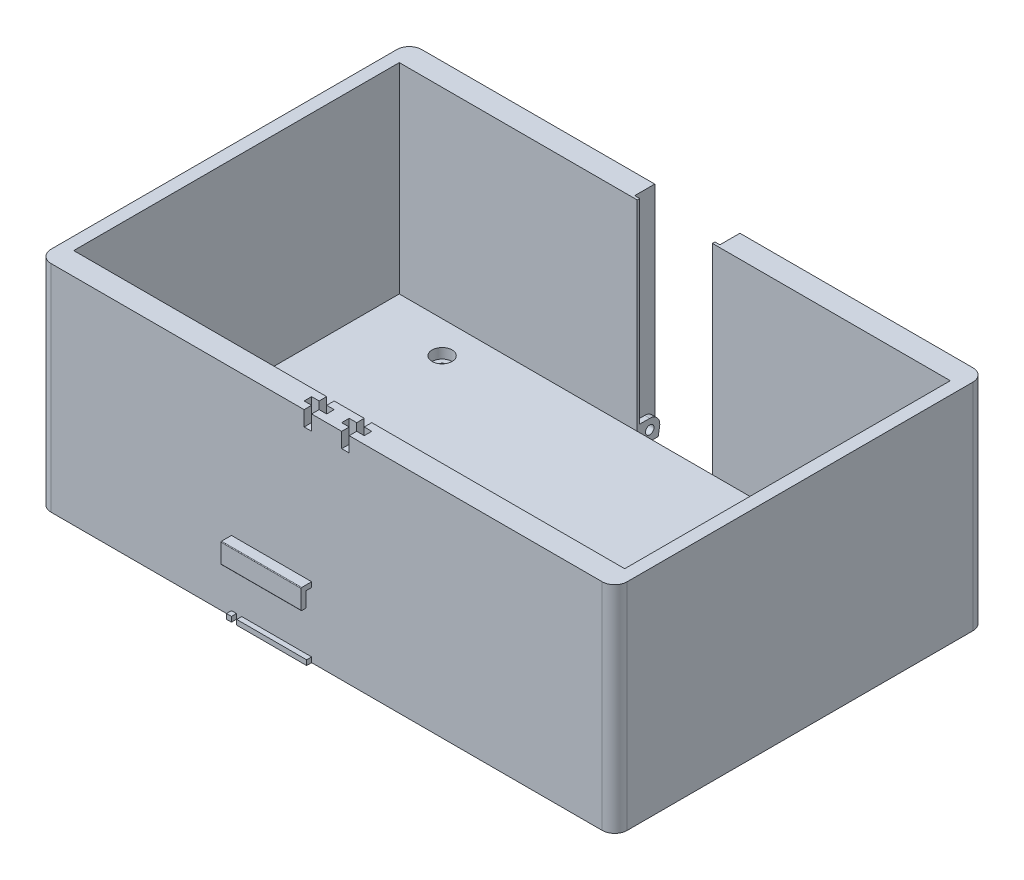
ISO-10303-21;
HEADER;
FILE_DESCRIPTION(('STEP AP214'),'2;1');
FILE_NAME('part.step','',(''),(''),'','','');
FILE_SCHEMA(('AUTOMOTIVE_DESIGN { 1 0 10303 214 1 1 1 1 }'));
ENDSEC;
DATA;
#1=APPLICATION_CONTEXT('core data for automotive mechanical design processes');
#2=APPLICATION_PROTOCOL_DEFINITION('international standard','automotive_design',2000,#1);
#3=PRODUCT_CONTEXT('',#1,'mechanical');
#4=PRODUCT('Part','Part','',(#3));
#5=PRODUCT_RELATED_PRODUCT_CATEGORY('part','',(#4));
#6=PRODUCT_DEFINITION_FORMATION('','',#4);
#7=PRODUCT_DEFINITION_CONTEXT('part definition',#1,'design');
#8=PRODUCT_DEFINITION('design','',#6,#7);
#9=PRODUCT_DEFINITION_SHAPE('','',#8);
#10=(LENGTH_UNIT() NAMED_UNIT(*) SI_UNIT(.MILLI.,.METRE.));
#11=(NAMED_UNIT(*) PLANE_ANGLE_UNIT() SI_UNIT($,.RADIAN.));
#12=(NAMED_UNIT(*) SI_UNIT($,.STERADIAN.) SOLID_ANGLE_UNIT());
#13=UNCERTAINTY_MEASURE_WITH_UNIT(LENGTH_MEASURE(1.E-05),#10,'distance_accuracy_value','');
#14=(GEOMETRIC_REPRESENTATION_CONTEXT(3) GLOBAL_UNCERTAINTY_ASSIGNED_CONTEXT((#13)) GLOBAL_UNIT_ASSIGNED_CONTEXT((#10,
#11,#12)) REPRESENTATION_CONTEXT('',''));
#15=CARTESIAN_POINT('',(0.,0.,0.));
#16=DIRECTION('',(0.,0.,1.));
#17=DIRECTION('',(1.,0.,0.));
#18=AXIS2_PLACEMENT_3D('',#15,#16,#17);
#19=CARTESIAN_POINT('',(85.9,86.,-55.5));
#20=DIRECTION('',(0.,-1.,0.));
#21=DIRECTION('',(0.,0.,-1.));
#22=AXIS2_PLACEMENT_3D('',#19,#20,#21);
#23=CYLINDRICAL_SURFACE('',#22,4.00000000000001);
#24=CARTESIAN_POINT('',(85.9,6.00000000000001,-55.5));
#25=DIRECTION('',(0.,1.,0.));
#26=DIRECTION('',(0.,0.,1.));
#27=AXIS2_PLACEMENT_3D('',#24,#25,#26);
#28=CIRCLE('',#27,4.00000000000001);
#29=CARTESIAN_POINT('',(85.9,6.00000000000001,-51.5));
#30=VERTEX_POINT('',#29);
#31=EDGE_CURVE('E1156',#30,#30,#28,.F.);
#32=ORIENTED_EDGE('',*,*,#31,.F.);
#33=EDGE_LOOP('',(#32));
#34=FACE_BOUND('',#33,.T.);
#35=CARTESIAN_POINT('',(85.9,2.,-55.5));
#36=DIRECTION('',(0.,1.,0.));
#37=DIRECTION('',(0.,0.,1.));
#38=AXIS2_PLACEMENT_3D('',#35,#36,#37);
#39=CIRCLE('',#38,4.00000000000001);
#40=CARTESIAN_POINT('',(85.9,2.,-51.5));
#41=VERTEX_POINT('',#40);
#42=EDGE_CURVE('E1159',#41,#41,#39,.T.);
#43=ORIENTED_EDGE('',*,*,#42,.F.);
#44=EDGE_LOOP('',(#43));
#45=FACE_BOUND('',#44,.T.);
#46=ADVANCED_FACE('F211',(#34,#45),#23,.F.);
#47=CARTESIAN_POINT('',(0.,0.,0.));
#48=DIRECTION('',(0.,-1.,0.));
#49=DIRECTION('',(0.,0.,-1.));
#50=AXIS2_PLACEMENT_3D('',#47,#48,#49);
#51=PLANE('',#50);
#52=CARTESIAN_POINT('',(0.,0.,0.));
#53=DIRECTION('',(0.,-1.,0.));
#54=DIRECTION('',(0.,0.,-1.));
#55=AXIS2_PLACEMENT_3D('',#52,#53,#54);
#56=CIRCLE('',#55,10.);
#57=CARTESIAN_POINT('',(0.,0.,-10.));
#58=VERTEX_POINT('',#57);
#59=EDGE_CURVE('E2274',#58,#58,#56,.T.);
#60=ORIENTED_EDGE('',*,*,#59,.F.);
#61=EDGE_LOOP('',(#60));
#62=FACE_BOUND('',#61,.T.);
#63=CARTESIAN_POINT('',(-80.1,0.,-52.2));
#64=DIRECTION('',(0.,1.,0.));
#65=DIRECTION('',(0.,0.,1.));
#66=AXIS2_PLACEMENT_3D('',#63,#64,#65);
#67=CIRCLE('',#66,2.);
#68=CARTESIAN_POINT('',(-80.1,0.,-50.2));
#69=VERTEX_POINT('',#68);
#70=EDGE_CURVE('E1158',#69,#69,#67,.T.);
#71=ORIENTED_EDGE('',*,*,#70,.T.);
#72=EDGE_LOOP('',(#71));
#73=FACE_BOUND('',#72,.T.);
#74=DIRECTION('',(0.,0.,1.));
#75=VECTOR('',#74,1.);
#76=CARTESIAN_POINT('',(17.,0.,0.));
#77=LINE('',#76,#75);
#78=CARTESIAN_POINT('',(17.,0.,-74.));
#79=VERTEX_POINT('',#78);
#80=CARTESIAN_POINT('',(17.,0.,-73.3563985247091));
#81=VERTEX_POINT('',#80);
#82=EDGE_CURVE('E660',#79,#81,#77,.T.);
#83=ORIENTED_EDGE('',*,*,#82,.F.);
#84=DIRECTION('',(-1.,0.,0.));
#85=VECTOR('',#84,1.);
#86=CARTESIAN_POINT('',(-115.,0.,-74.));
#87=LINE('',#86,#85);
#88=CARTESIAN_POINT('',(110.,0.,-74.));
#89=VERTEX_POINT('',#88);
#90=EDGE_CURVE('E659',#89,#79,#87,.T.);
#91=ORIENTED_EDGE('',*,*,#90,.F.);
#92=CARTESIAN_POINT('',(110.,0.,-69.));
#93=DIRECTION('',(0.,-1.,0.));
#94=DIRECTION('',(0.,0.,-1.));
#95=AXIS2_PLACEMENT_3D('',#92,#93,#94);
#96=CIRCLE('',#95,5.);
#97=CARTESIAN_POINT('',(115.,0.,-69.));
#98=VERTEX_POINT('',#97);
#99=EDGE_CURVE('E1100',#89,#98,#96,.T.);
#100=ORIENTED_EDGE('',*,*,#99,.T.);
#101=DIRECTION('',(0.,0.,-1.));
#102=VECTOR('',#101,1.);
#103=CARTESIAN_POINT('',(115.,0.,-74.));
#104=LINE('',#103,#102);
#105=CARTESIAN_POINT('',(115.,0.,69.));
#106=VERTEX_POINT('',#105);
#107=EDGE_CURVE('E1060',#106,#98,#104,.T.);
#108=ORIENTED_EDGE('',*,*,#107,.F.);
#109=CARTESIAN_POINT('',(110.,0.,69.));
#110=DIRECTION('',(0.,-1.,0.));
#111=DIRECTION('',(0.,0.,-1.));
#112=AXIS2_PLACEMENT_3D('',#109,#110,#111);
#113=CIRCLE('',#112,5.);
#114=CARTESIAN_POINT('',(110.,0.,74.));
#115=VERTEX_POINT('',#114);
#116=EDGE_CURVE('E1102',#106,#115,#113,.T.);
#117=ORIENTED_EDGE('',*,*,#116,.T.);
#118=DIRECTION('',(1.,0.,0.));
#119=VECTOR('',#118,1.);
#120=CARTESIAN_POINT('',(-115.,0.,74.));
#121=LINE('',#120,#119);
#122=CARTESIAN_POINT('',(-6.00000000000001,0.,74.));
#123=VERTEX_POINT('',#122);
#124=EDGE_CURVE('E1057',#123,#115,#121,.T.);
#125=ORIENTED_EDGE('',*,*,#124,.F.);
#126=DIRECTION('',(0.,0.,-1.));
#127=VECTOR('',#126,1.);
#128=CARTESIAN_POINT('',(-6.,0.,74.));
#129=LINE('',#128,#127);
#130=CARTESIAN_POINT('',(-6.,0.,76.));
#131=VERTEX_POINT('',#130);
#132=EDGE_CURVE('E763',#131,#123,#129,.T.);
#133=ORIENTED_EDGE('',*,*,#132,.F.);
#134=DIRECTION('',(1.,0.,0.));
#135=VECTOR('',#134,1.);
#136=CARTESIAN_POINT('',(-38.,0.,76.));
#137=LINE('',#136,#135);
#138=CARTESIAN_POINT('',(-33.9,0.,76.));
#139=VERTEX_POINT('',#138);
#140=EDGE_CURVE('E787',#139,#131,#137,.T.);
#141=ORIENTED_EDGE('',*,*,#140,.F.);
#142=DIRECTION('',(0.,0.,1.));
#143=VECTOR('',#142,1.);
#144=CARTESIAN_POINT('',(-33.9,0.,71.1));
#145=LINE('',#144,#143);
#146=CARTESIAN_POINT('',(-33.9,0.,74.));
#147=VERTEX_POINT('',#146);
#148=EDGE_CURVE('E753',#147,#139,#145,.T.);
#149=ORIENTED_EDGE('',*,*,#148,.F.);
#150=DIRECTION('',(-1.,0.,0.));
#151=VECTOR('',#150,1.);
#152=CARTESIAN_POINT('',(-36.,0.,74.));
#153=LINE('',#152,#151);
#154=CARTESIAN_POINT('',(-36.,0.,74.));
#155=VERTEX_POINT('',#154);
#156=EDGE_CURVE('E744',#147,#155,#153,.T.);
#157=ORIENTED_EDGE('',*,*,#156,.T.);
#158=DIRECTION('',(0.,0.,1.));
#159=VECTOR('',#158,1.);
#160=CARTESIAN_POINT('',(-36.,0.,71.1));
#161=LINE('',#160,#159);
#162=CARTESIAN_POINT('',(-36.,0.,76.));
#163=VERTEX_POINT('',#162);
#164=EDGE_CURVE('E748',#155,#163,#161,.T.);
#165=ORIENTED_EDGE('',*,*,#164,.T.);
#166=CARTESIAN_POINT('',(-38.,0.,76.));
#167=VERTEX_POINT('',#166);
#168=EDGE_CURVE('E783',#167,#163,#137,.T.);
#169=ORIENTED_EDGE('',*,*,#168,.F.);
#170=DIRECTION('',(0.,0.,-1.));
#171=VECTOR('',#170,1.);
#172=CARTESIAN_POINT('',(-38.,0.,74.));
#173=LINE('',#172,#171);
#174=CARTESIAN_POINT('',(-38.,0.,74.));
#175=VERTEX_POINT('',#174);
#176=EDGE_CURVE('E769',#167,#175,#173,.T.);
#177=ORIENTED_EDGE('',*,*,#176,.T.);
#178=CARTESIAN_POINT('',(-110.,0.,74.));
#179=VERTEX_POINT('',#178);
#180=EDGE_CURVE('E1058',#179,#175,#121,.T.);
#181=ORIENTED_EDGE('',*,*,#180,.F.);
#182=CARTESIAN_POINT('',(-110.,0.,69.));
#183=DIRECTION('',(0.,-1.,0.));
#184=DIRECTION('',(0.,0.,-1.));
#185=AXIS2_PLACEMENT_3D('',#182,#183,#184);
#186=CIRCLE('',#185,5.);
#187=CARTESIAN_POINT('',(-115.,0.,69.));
#188=VERTEX_POINT('',#187);
#189=EDGE_CURVE('E1105',#179,#188,#186,.T.);
#190=ORIENTED_EDGE('',*,*,#189,.T.);
#191=DIRECTION('',(0.,0.,1.));
#192=VECTOR('',#191,1.);
#193=CARTESIAN_POINT('',(-115.,0.,-74.));
#194=LINE('',#193,#192);
#195=CARTESIAN_POINT('',(-115.,0.,-69.));
#196=VERTEX_POINT('',#195);
#197=EDGE_CURVE('E1048',#196,#188,#194,.T.);
#198=ORIENTED_EDGE('',*,*,#197,.F.);
#199=CARTESIAN_POINT('',(-110.,0.,-69.));
#200=DIRECTION('',(0.,-1.,0.));
#201=DIRECTION('',(0.,0.,-1.));
#202=AXIS2_PLACEMENT_3D('',#199,#200,#201);
#203=CIRCLE('',#202,5.);
#204=CARTESIAN_POINT('',(-110.,0.,-74.));
#205=VERTEX_POINT('',#204);
#206=EDGE_CURVE('E1097',#196,#205,#203,.T.);
#207=ORIENTED_EDGE('',*,*,#206,.T.);
#208=CARTESIAN_POINT('',(-17.,0.,-74.));
#209=VERTEX_POINT('',#208);
#210=EDGE_CURVE('E1063',#209,#205,#87,.T.);
#211=ORIENTED_EDGE('',*,*,#210,.F.);
#212=DIRECTION('',(0.,0.,1.));
#213=VECTOR('',#212,1.);
#214=CARTESIAN_POINT('',(-17.,0.,0.));
#215=LINE('',#214,#213);
#216=CARTESIAN_POINT('',(-17.,0.,-73.3563985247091));
#217=VERTEX_POINT('',#216);
#218=EDGE_CURVE('E1199',#209,#217,#215,.T.);
#219=ORIENTED_EDGE('',*,*,#218,.T.);
#220=DIRECTION('',(-1.,0.,0.));
#221=VECTOR('',#220,1.);
#222=CARTESIAN_POINT('',(0.,0.,-73.3563985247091));
#223=LINE('',#222,#221);
#224=CARTESIAN_POINT('',(-15.,0.,-73.3563985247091));
#225=VERTEX_POINT('',#224);
#226=EDGE_CURVE('E1140',#225,#217,#223,.T.);
#227=ORIENTED_EDGE('',*,*,#226,.F.);
#228=DIRECTION('',(0.,0.,-1.));
#229=VECTOR('',#228,1.);
#230=CARTESIAN_POINT('',(-15.,0.,26.0823802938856));
#231=LINE('',#230,#229);
#232=CARTESIAN_POINT('',(-15.,0.,-65.));
#233=VERTEX_POINT('',#232);
#234=EDGE_CURVE('E1011',#233,#225,#231,.T.);
#235=ORIENTED_EDGE('',*,*,#234,.F.);
#236=DIRECTION('',(-1.,0.,0.));
#237=VECTOR('',#236,1.);
#238=CARTESIAN_POINT('',(-15.,0.,-65.));
#239=LINE('',#238,#237);
#240=CARTESIAN_POINT('',(15.,0.,-65.));
#241=VERTEX_POINT('',#240);
#242=EDGE_CURVE('E994',#241,#233,#239,.T.);
#243=ORIENTED_EDGE('',*,*,#242,.F.);
#244=DIRECTION('',(0.,0.,-1.));
#245=VECTOR('',#244,1.);
#246=CARTESIAN_POINT('',(15.,0.,26.0823802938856));
#247=LINE('',#246,#245);
#248=CARTESIAN_POINT('',(15.,0.,-73.3563985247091));
#249=VERTEX_POINT('',#248);
#250=EDGE_CURVE('E1008',#241,#249,#247,.T.);
#251=ORIENTED_EDGE('',*,*,#250,.T.);
#252=DIRECTION('',(-1.,0.,0.));
#253=VECTOR('',#252,1.);
#254=CARTESIAN_POINT('',(22.6568542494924,0.,-73.3563985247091));
#255=LINE('',#254,#253);
#256=EDGE_CURVE('E1187',#81,#249,#255,.T.);
#257=ORIENTED_EDGE('',*,*,#256,.F.);
#258=EDGE_LOOP('',(#83,#91,#100,#108,#117,#125,#133,#141,#149,#157,#165,#169,#177,#181,#190,
#198,#207,#211,#219,#227,#235,#243,#251,#257));
#259=FACE_BOUND('',#258,.T.);
#260=CARTESIAN_POINT('',(-80.1,0.,52.2));
#261=DIRECTION('',(0.,-1.,0.));
#262=DIRECTION('',(0.,0.,-1.));
#263=AXIS2_PLACEMENT_3D('',#260,#261,#262);
#264=CIRCLE('',#263,2.);
#265=CARTESIAN_POINT('',(-80.1,0.,50.2));
#266=VERTEX_POINT('',#265);
#267=EDGE_CURVE('E1149',#266,#266,#264,.T.);
#268=ORIENTED_EDGE('',*,*,#267,.F.);
#269=EDGE_LOOP('',(#268));
#270=FACE_BOUND('',#269,.T.);
#271=CARTESIAN_POINT('',(85.9,0.,55.5));
#272=DIRECTION('',(0.,-1.,0.));
#273=DIRECTION('',(0.,0.,-1.));
#274=AXIS2_PLACEMENT_3D('',#271,#272,#273);
#275=CIRCLE('',#274,2.);
#276=CARTESIAN_POINT('',(85.9,0.,53.5));
#277=VERTEX_POINT('',#276);
#278=EDGE_CURVE('E1154',#277,#277,#275,.T.);
#279=ORIENTED_EDGE('',*,*,#278,.F.);
#280=EDGE_LOOP('',(#279));
#281=FACE_BOUND('',#280,.T.);
#282=CARTESIAN_POINT('',(85.9,0.,-55.5));
#283=DIRECTION('',(0.,1.,0.));
#284=DIRECTION('',(0.,0.,1.));
#285=AXIS2_PLACEMENT_3D('',#282,#283,#284);
#286=CIRCLE('',#285,2.);
#287=CARTESIAN_POINT('',(85.9,0.,-53.5));
#288=VERTEX_POINT('',#287);
#289=EDGE_CURVE('E1171',#288,#288,#286,.T.);
#290=ORIENTED_EDGE('',*,*,#289,.T.);
#291=EDGE_LOOP('',(#290));
#292=FACE_BOUND('',#291,.T.);
#293=ADVANCED_FACE('F1217',(#62,#73,#259,#270,#281,#292),#51,.T.);
#294=CARTESIAN_POINT('',(0.,6.00000000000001,0.));
#295=DIRECTION('',(0.,1.,0.));
#296=DIRECTION('',(0.,0.,1.));
#297=AXIS2_PLACEMENT_3D('',#294,#295,#296);
#298=PLANE('',#297);
#299=CARTESIAN_POINT('',(0.,6.00000000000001,0.));
#300=DIRECTION('',(0.,1.,0.));
#301=DIRECTION('',(0.,0.,1.));
#302=AXIS2_PLACEMENT_3D('',#299,#300,#301);
#303=CIRCLE('',#302,10.);
#304=CARTESIAN_POINT('',(0.,6.00000000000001,10.));
#305=VERTEX_POINT('',#304);
#306=EDGE_CURVE('E215',#305,#305,#303,.T.);
#307=ORIENTED_EDGE('',*,*,#306,.F.);
#308=EDGE_LOOP('',(#307));
#309=FACE_BOUND('',#308,.T.);
#310=CARTESIAN_POINT('',(-80.1,6.00000000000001,-52.2));
#311=DIRECTION('',(0.,1.,0.));
#312=DIRECTION('',(0.,0.,1.));
#313=AXIS2_PLACEMENT_3D('',#310,#311,#312);
#314=CIRCLE('',#313,4.00000000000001);
#315=CARTESIAN_POINT('',(-80.1,6.00000000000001,-48.2));
#316=VERTEX_POINT('',#315);
#317=EDGE_CURVE('E1152',#316,#316,#314,.F.);
#318=ORIENTED_EDGE('',*,*,#317,.T.);
#319=EDGE_LOOP('',(#318));
#320=FACE_BOUND('',#319,.T.);
#321=CARTESIAN_POINT('',(85.9,6.00000000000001,55.5));
#322=DIRECTION('',(0.,1.,0.));
#323=DIRECTION('',(0.,0.,1.));
#324=AXIS2_PLACEMENT_3D('',#321,#322,#323);
#325=CIRCLE('',#324,4.00000000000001);
#326=CARTESIAN_POINT('',(85.9,6.00000000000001,59.5));
#327=VERTEX_POINT('',#326);
#328=EDGE_CURVE('E1147',#327,#327,#325,.T.);
#329=ORIENTED_EDGE('',*,*,#328,.F.);
#330=EDGE_LOOP('',(#329));
#331=FACE_BOUND('',#330,.T.);
#332=CARTESIAN_POINT('',(-80.1,6.00000000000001,52.2));
#333=DIRECTION('',(0.,1.,0.));
#334=DIRECTION('',(0.,0.,1.));
#335=AXIS2_PLACEMENT_3D('',#332,#333,#334);
#336=CIRCLE('',#335,4.00000000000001);
#337=CARTESIAN_POINT('',(-80.1,6.00000000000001,56.2));
#338=VERTEX_POINT('',#337);
#339=EDGE_CURVE('E649',#338,#338,#336,.T.);
#340=ORIENTED_EDGE('',*,*,#339,.F.);
#341=EDGE_LOOP('',(#340));
#342=FACE_BOUND('',#341,.T.);
#343=DIRECTION('',(0.,0.,1.));
#344=VECTOR('',#343,1.);
#345=CARTESIAN_POINT('',(-110.,6.00000000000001,-65.));
#346=LINE('',#345,#344);
#347=CARTESIAN_POINT('',(-110.,6.00000000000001,-65.));
#348=VERTEX_POINT('',#347);
#349=CARTESIAN_POINT('',(-110.,6.00000000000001,65.));
#350=VERTEX_POINT('',#349);
#351=EDGE_CURVE('E689',#348,#350,#346,.T.);
#352=ORIENTED_EDGE('',*,*,#351,.T.);
#353=DIRECTION('',(1.,0.,0.));
#354=VECTOR('',#353,1.);
#355=CARTESIAN_POINT('',(-110.,6.00000000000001,65.));
#356=LINE('',#355,#354);
#357=CARTESIAN_POINT('',(110.,6.00000000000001,65.));
#358=VERTEX_POINT('',#357);
#359=EDGE_CURVE('E692',#350,#358,#356,.T.);
#360=ORIENTED_EDGE('',*,*,#359,.T.);
#361=DIRECTION('',(0.,0.,-1.));
#362=VECTOR('',#361,1.);
#363=CARTESIAN_POINT('',(110.,6.00000000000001,-65.));
#364=LINE('',#363,#362);
#365=CARTESIAN_POINT('',(110.,6.00000000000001,-65.));
#366=VERTEX_POINT('',#365);
#367=EDGE_CURVE('E695',#358,#366,#364,.T.);
#368=ORIENTED_EDGE('',*,*,#367,.T.);
#369=DIRECTION('',(1.,0.,0.));
#370=VECTOR('',#369,1.);
#371=CARTESIAN_POINT('',(-17.5,6.,-65.));
#372=LINE('',#371,#370);
#373=CARTESIAN_POINT('',(15.,6.00000000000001,-65.));
#374=VERTEX_POINT('',#373);
#375=EDGE_CURVE('E1065',#374,#366,#372,.T.);
#376=ORIENTED_EDGE('',*,*,#375,.F.);
#377=DIRECTION('',(-1.,0.,0.));
#378=VECTOR('',#377,1.);
#379=CARTESIAN_POINT('',(-17.5,6.,-65.));
#380=LINE('',#379,#378);
#381=CARTESIAN_POINT('',(-15.,6.00000000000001,-65.));
#382=VERTEX_POINT('',#381);
#383=EDGE_CURVE('E1002',#374,#382,#380,.T.);
#384=ORIENTED_EDGE('',*,*,#383,.T.);
#385=EDGE_CURVE('E1068',#348,#382,#372,.T.);
#386=ORIENTED_EDGE('',*,*,#385,.F.);
#387=EDGE_LOOP('',(#352,#360,#368,#376,#384,#386));
#388=FACE_BOUND('',#387,.T.);
#389=ORIENTED_EDGE('',*,*,#31,.T.);
#390=EDGE_LOOP('',(#389));
#391=FACE_BOUND('',#390,.T.);
#392=ADVANCED_FACE('F1348',(#309,#320,#331,#342,#388,#391),#298,.T.);
#393=CARTESIAN_POINT('',(-80.1,86.,-52.2));
#394=DIRECTION('',(0.,-1.,0.));
#395=DIRECTION('',(0.,0.,-1.));
#396=AXIS2_PLACEMENT_3D('',#393,#394,#395);
#397=CYLINDRICAL_SURFACE('',#396,4.00000000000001);
#398=ORIENTED_EDGE('',*,*,#317,.F.);
#399=EDGE_LOOP('',(#398));
#400=FACE_BOUND('',#399,.T.);
#401=CARTESIAN_POINT('',(-80.1,2.,-52.2));
#402=DIRECTION('',(0.,1.,0.));
#403=DIRECTION('',(0.,0.,1.));
#404=AXIS2_PLACEMENT_3D('',#401,#402,#403);
#405=CIRCLE('',#404,4.00000000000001);
#406=CARTESIAN_POINT('',(-80.1,2.,-48.2));
#407=VERTEX_POINT('',#406);
#408=EDGE_CURVE('E1155',#407,#407,#405,.T.);
#409=ORIENTED_EDGE('',*,*,#408,.F.);
#410=EDGE_LOOP('',(#409));
#411=FACE_BOUND('',#410,.T.);
#412=ADVANCED_FACE('F1449',(#400,#411),#397,.F.);
#413=CARTESIAN_POINT('',(85.9,86.,55.5));
#414=DIRECTION('',(0.,-1.,0.));
#415=DIRECTION('',(0.,0.,-1.));
#416=AXIS2_PLACEMENT_3D('',#413,#414,#415);
#417=CYLINDRICAL_SURFACE('',#416,4.00000000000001);
#418=ORIENTED_EDGE('',*,*,#328,.T.);
#419=EDGE_LOOP('',(#418));
#420=FACE_BOUND('',#419,.T.);
#421=CARTESIAN_POINT('',(85.9,2.,55.5));
#422=DIRECTION('',(0.,-1.,0.));
#423=DIRECTION('',(0.,0.,-1.));
#424=AXIS2_PLACEMENT_3D('',#421,#422,#423);
#425=CIRCLE('',#424,4.00000000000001);
#426=CARTESIAN_POINT('',(85.9,2.,51.5));
#427=VERTEX_POINT('',#426);
#428=EDGE_CURVE('E12',#427,#427,#425,.F.);
#429=ORIENTED_EDGE('',*,*,#428,.F.);
#430=EDGE_LOOP('',(#429));
#431=FACE_BOUND('',#430,.T.);
#432=ADVANCED_FACE('F1452',(#420,#431),#417,.F.);
#433=CARTESIAN_POINT('',(-80.1,86.,52.2));
#434=DIRECTION('',(0.,-1.,0.));
#435=DIRECTION('',(0.,0.,-1.));
#436=AXIS2_PLACEMENT_3D('',#433,#434,#435);
#437=CYLINDRICAL_SURFACE('',#436,4.00000000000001);
#438=ORIENTED_EDGE('',*,*,#339,.T.);
#439=EDGE_LOOP('',(#438));
#440=FACE_BOUND('',#439,.T.);
#441=CARTESIAN_POINT('',(-80.1,2.,52.2));
#442=DIRECTION('',(0.,-1.,0.));
#443=DIRECTION('',(0.,0.,-1.));
#444=AXIS2_PLACEMENT_3D('',#441,#442,#443);
#445=CIRCLE('',#444,4.00000000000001);
#446=CARTESIAN_POINT('',(-80.1,2.,48.2));
#447=VERTEX_POINT('',#446);
#448=EDGE_CURVE('E220',#447,#447,#445,.F.);
#449=ORIENTED_EDGE('',*,*,#448,.F.);
#450=EDGE_LOOP('',(#449));
#451=FACE_BOUND('',#450,.T.);
#452=ADVANCED_FACE('F1464',(#440,#451),#437,.F.);
#453=CARTESIAN_POINT('',(-15.,86.,26.0823802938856));
#454=DIRECTION('',(1.,0.,0.));
#455=DIRECTION('',(0.,1.,0.));
#456=AXIS2_PLACEMENT_3D('',#453,#454,#455);
#457=PLANE('',#456);
#458=DIRECTION('',(0.,-0.984807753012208,0.173648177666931));
#459=VECTOR('',#458,1.);
#460=CARTESIAN_POINT('',(-15.,66.4017500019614,-85.0648186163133));
#461=LINE('',#460,#459);
#462=CARTESIAN_POINT('',(-15.,3.30540728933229,-73.9392310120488));
#463=VERTEX_POINT('',#462);
#464=EDGE_CURVE('E680',#463,#225,#461,.T.);
#465=ORIENTED_EDGE('',*,*,#464,.F.);
#466=CARTESIAN_POINT('',(-15.,4.00000000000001,-70.));
#467=DIRECTION('',(1.,0.,0.));
#468=DIRECTION('',(0.,1.,0.));
#469=AXIS2_PLACEMENT_3D('',#466,#467,#468);
#470=CIRCLE('',#469,3.99999999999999);
#471=CARTESIAN_POINT('',(-15.,7.99999999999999,-70.));
#472=VERTEX_POINT('',#471);
#473=EDGE_CURVE('E686',#463,#472,#470,.T.);
#474=ORIENTED_EDGE('',*,*,#473,.T.);
#475=DIRECTION('',(0.,0.,-1.));
#476=VECTOR('',#475,1.);
#477=CARTESIAN_POINT('',(-15.,7.99999999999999,26.0823802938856));
#478=LINE('',#477,#476);
#479=CARTESIAN_POINT('',(-15.,8.,-66.));
#480=VERTEX_POINT('',#479);
#481=EDGE_CURVE('E1076',#480,#472,#478,.T.);
#482=ORIENTED_EDGE('',*,*,#481,.F.);
#483=DIRECTION('',(0.,1.,0.));
#484=VECTOR('',#483,1.);
#485=CARTESIAN_POINT('',(-15.,86.,-66.));
#486=LINE('',#485,#484);
#487=CARTESIAN_POINT('',(-15.,86.,-66.));
#488=VERTEX_POINT('',#487);
#489=EDGE_CURVE('E1073',#480,#488,#486,.T.);
#490=ORIENTED_EDGE('',*,*,#489,.T.);
#491=DIRECTION('',(0.,0.,-1.));
#492=VECTOR('',#491,1.);
#493=CARTESIAN_POINT('',(-15.,86.,26.0823802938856));
#494=LINE('',#493,#492);
#495=CARTESIAN_POINT('',(-15.,86.,-65.));
#496=VERTEX_POINT('',#495);
#497=EDGE_CURVE('E990',#496,#488,#494,.T.);
#498=ORIENTED_EDGE('',*,*,#497,.F.);
#499=DIRECTION('',(0.,1.,0.));
#500=VECTOR('',#499,1.);
#501=CARTESIAN_POINT('',(-15.,86.,-65.));
#502=LINE('',#501,#500);
#503=EDGE_CURVE('E998',#382,#496,#502,.T.);
#504=ORIENTED_EDGE('',*,*,#503,.F.);
#505=EDGE_CURVE('E999',#233,#382,#502,.T.);
#506=ORIENTED_EDGE('',*,*,#505,.F.);
#507=ORIENTED_EDGE('',*,*,#234,.T.);
#508=EDGE_LOOP('',(#465,#474,#482,#490,#498,#504,#506,#507));
#509=FACE_BOUND('',#508,.T.);
#510=CARTESIAN_POINT('',(-15.,4.00000000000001,-70.));
#511=DIRECTION('',(-1.,0.,0.));
#512=DIRECTION('',(0.,-1.,0.));
#513=AXIS2_PLACEMENT_3D('',#510,#511,#512);
#514=CIRCLE('',#513,1.7);
#515=CARTESIAN_POINT('',(-15.,2.30000000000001,-70.));
#516=VERTEX_POINT('',#515);
#517=EDGE_CURVE('E951',#516,#516,#514,.T.);
#518=ORIENTED_EDGE('',*,*,#517,.T.);
#519=EDGE_LOOP('',(#518));
#520=FACE_BOUND('',#519,.T.);
#521=ADVANCED_FACE('F1221',(#509,#520),#457,.T.);
#522=CARTESIAN_POINT('',(15.,86.,26.0823802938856));
#523=DIRECTION('',(-1.,0.,0.));
#524=DIRECTION('',(0.,-1.,0.));
#525=AXIS2_PLACEMENT_3D('',#522,#523,#524);
#526=PLANE('',#525);
#527=DIRECTION('',(0.,0.984807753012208,-0.173648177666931));
#528=VECTOR('',#527,1.);
#529=CARTESIAN_POINT('',(15.,66.4017500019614,-85.0648186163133));
#530=LINE('',#529,#528);
#531=CARTESIAN_POINT('',(15.,3.30540728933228,-73.9392310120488));
#532=VERTEX_POINT('',#531);
#533=EDGE_CURVE('E1198',#249,#532,#530,.T.);
#534=ORIENTED_EDGE('',*,*,#533,.F.);
#535=ORIENTED_EDGE('',*,*,#250,.F.);
#536=DIRECTION('',(0.,-1.,0.));
#537=VECTOR('',#536,1.);
#538=CARTESIAN_POINT('',(15.,86.,-65.));
#539=LINE('',#538,#537);
#540=EDGE_CURVE('E995',#374,#241,#539,.T.);
#541=ORIENTED_EDGE('',*,*,#540,.F.);
#542=CARTESIAN_POINT('',(15.,86.,-65.));
#543=VERTEX_POINT('',#542);
#544=EDGE_CURVE('E991',#543,#374,#539,.T.);
#545=ORIENTED_EDGE('',*,*,#544,.F.);
#546=DIRECTION('',(0.,0.,-1.));
#547=VECTOR('',#546,1.);
#548=CARTESIAN_POINT('',(15.,86.,26.0823802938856));
#549=LINE('',#548,#547);
#550=CARTESIAN_POINT('',(15.,86.,-66.));
#551=VERTEX_POINT('',#550);
#552=EDGE_CURVE('E1005',#543,#551,#549,.T.);
#553=ORIENTED_EDGE('',*,*,#552,.T.);
#554=DIRECTION('',(0.,-1.,0.));
#555=VECTOR('',#554,1.);
#556=CARTESIAN_POINT('',(15.,86.,-66.));
#557=LINE('',#556,#555);
#558=CARTESIAN_POINT('',(15.,8.00000000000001,-66.));
#559=VERTEX_POINT('',#558);
#560=EDGE_CURVE('E978',#551,#559,#557,.T.);
#561=ORIENTED_EDGE('',*,*,#560,.T.);
#562=DIRECTION('',(0.,0.,1.));
#563=VECTOR('',#562,1.);
#564=CARTESIAN_POINT('',(15.,7.99999999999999,26.0823802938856));
#565=LINE('',#564,#563);
#566=CARTESIAN_POINT('',(15.,7.99999999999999,-70.));
#567=VERTEX_POINT('',#566);
#568=EDGE_CURVE('E988',#567,#559,#565,.T.);
#569=ORIENTED_EDGE('',*,*,#568,.F.);
#570=CARTESIAN_POINT('',(15.,4.00000000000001,-70.));
#571=DIRECTION('',(-1.,0.,0.));
#572=DIRECTION('',(0.,-1.,0.));
#573=AXIS2_PLACEMENT_3D('',#570,#571,#572);
#574=CIRCLE('',#573,3.99999999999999);
#575=EDGE_CURVE('E684',#567,#532,#574,.T.);
#576=ORIENTED_EDGE('',*,*,#575,.T.);
#577=EDGE_LOOP('',(#534,#535,#541,#545,#553,#561,#569,#576));
#578=FACE_BOUND('',#577,.T.);
#579=CARTESIAN_POINT('',(15.,4.00000000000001,-70.));
#580=DIRECTION('',(-1.,0.,0.));
#581=DIRECTION('',(0.,-1.,0.));
#582=AXIS2_PLACEMENT_3D('',#579,#580,#581);
#583=CIRCLE('',#582,1.7);
#584=CARTESIAN_POINT('',(15.,2.30000000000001,-70.));
#585=VERTEX_POINT('',#584);
#586=EDGE_CURVE('E955',#585,#585,#583,.T.);
#587=ORIENTED_EDGE('',*,*,#586,.F.);
#588=EDGE_LOOP('',(#587));
#589=FACE_BOUND('',#588,.T.);
#590=ADVANCED_FACE('F1234',(#578,#589),#526,.T.);
#591=CARTESIAN_POINT('',(-115.,0.,74.));
#592=DIRECTION('',(0.,0.,1.));
#593=DIRECTION('',(1.,0.,0.));
#594=AXIS2_PLACEMENT_3D('',#591,#592,#593);
#595=PLANE('',#594);
#596=ORIENTED_EDGE('',*,*,#180,.T.);
#597=DIRECTION('',(0.,1.,0.));
#598=VECTOR('',#597,1.);
#599=CARTESIAN_POINT('',(-38.,0.,74.));
#600=LINE('',#599,#598);
#601=CARTESIAN_POINT('',(-38.,2.,74.));
#602=VERTEX_POINT('',#601);
#603=EDGE_CURVE('E760',#175,#602,#600,.T.);
#604=ORIENTED_EDGE('',*,*,#603,.T.);
#605=DIRECTION('',(1.,0.,0.));
#606=VECTOR('',#605,1.);
#607=CARTESIAN_POINT('',(-38.,2.,74.));
#608=LINE('',#607,#606);
#609=CARTESIAN_POINT('',(-36.,2.,74.));
#610=VERTEX_POINT('',#609);
#611=EDGE_CURVE('E792',#602,#610,#608,.T.);
#612=ORIENTED_EDGE('',*,*,#611,.T.);
#613=DIRECTION('',(0.,1.,0.));
#614=VECTOR('',#613,1.);
#615=CARTESIAN_POINT('',(-36.,2.,74.));
#616=LINE('',#615,#614);
#617=EDGE_CURVE('E741',#155,#610,#616,.T.);
#618=ORIENTED_EDGE('',*,*,#617,.F.);
#619=ORIENTED_EDGE('',*,*,#156,.F.);
#620=DIRECTION('',(0.,-1.,0.));
#621=VECTOR('',#620,1.);
#622=CARTESIAN_POINT('',(-33.9,2.,74.));
#623=LINE('',#622,#621);
#624=CARTESIAN_POINT('',(-33.9,2.,74.));
#625=VERTEX_POINT('',#624);
#626=EDGE_CURVE('E739',#625,#147,#623,.T.);
#627=ORIENTED_EDGE('',*,*,#626,.F.);
#628=CARTESIAN_POINT('',(-6.,2.,74.));
#629=VERTEX_POINT('',#628);
#630=EDGE_CURVE('E772',#625,#629,#608,.T.);
#631=ORIENTED_EDGE('',*,*,#630,.T.);
#632=DIRECTION('',(0.,1.,0.));
#633=VECTOR('',#632,1.);
#634=CARTESIAN_POINT('',(-6.,0.,74.));
#635=LINE('',#634,#633);
#636=EDGE_CURVE('E759',#123,#629,#635,.T.);
#637=ORIENTED_EDGE('',*,*,#636,.F.);
#638=ORIENTED_EDGE('',*,*,#124,.T.);
#639=DIRECTION('',(0.,1.,0.));
#640=VECTOR('',#639,1.);
#641=CARTESIAN_POINT('',(110.,0.,74.));
#642=LINE('',#641,#640);
#643=CARTESIAN_POINT('',(110.,86.,74.));
#644=VERTEX_POINT('',#643);
#645=EDGE_CURVE('E1092',#115,#644,#642,.T.);
#646=ORIENTED_EDGE('',*,*,#645,.T.);
#647=DIRECTION('',(1.,0.,0.));
#648=VECTOR('',#647,1.);
#649=CARTESIAN_POINT('',(-115.,86.,74.));
#650=LINE('',#649,#648);
#651=CARTESIAN_POINT('',(9.00000000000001,86.,74.));
#652=VERTEX_POINT('',#651);
#653=EDGE_CURVE('E1033',#652,#644,#650,.T.);
#654=ORIENTED_EDGE('',*,*,#653,.F.);
#655=DIRECTION('',(0.,1.,0.));
#656=VECTOR('',#655,1.);
#657=CARTESIAN_POINT('',(9.00000000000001,80.,74.));
#658=LINE('',#657,#656);
#659=CARTESIAN_POINT('',(9.00000000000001,80.,74.));
#660=VERTEX_POINT('',#659);
#661=EDGE_CURVE('E929',#660,#652,#658,.T.);
#662=ORIENTED_EDGE('',*,*,#661,.F.);
#663=DIRECTION('',(1.,0.,0.));
#664=VECTOR('',#663,1.);
#665=CARTESIAN_POINT('',(6.,80.,74.));
#666=LINE('',#665,#664);
#667=CARTESIAN_POINT('',(6.,80.,74.));
#668=VERTEX_POINT('',#667);
#669=EDGE_CURVE('E926',#668,#660,#666,.T.);
#670=ORIENTED_EDGE('',*,*,#669,.F.);
#671=DIRECTION('',(0.,-1.,0.));
#672=VECTOR('',#671,1.);
#673=CARTESIAN_POINT('',(6.00000000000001,86.,74.));
#674=LINE('',#673,#672);
#675=CARTESIAN_POINT('',(6.00000000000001,86.,74.));
#676=VERTEX_POINT('',#675);
#677=EDGE_CURVE('E923',#676,#668,#674,.T.);
#678=ORIENTED_EDGE('',*,*,#677,.F.);
#679=CARTESIAN_POINT('',(-6.,86.,74.));
#680=VERTEX_POINT('',#679);
#681=EDGE_CURVE('E1038',#680,#676,#650,.T.);
#682=ORIENTED_EDGE('',*,*,#681,.F.);
#683=DIRECTION('',(0.,1.,0.));
#684=VECTOR('',#683,1.);
#685=CARTESIAN_POINT('',(-6.,86.,74.));
#686=LINE('',#685,#684);
#687=CARTESIAN_POINT('',(-6.,80.,74.));
#688=VERTEX_POINT('',#687);
#689=EDGE_CURVE('E895',#688,#680,#686,.T.);
#690=ORIENTED_EDGE('',*,*,#689,.F.);
#691=DIRECTION('',(1.,0.,0.));
#692=VECTOR('',#691,1.);
#693=CARTESIAN_POINT('',(-6.,80.,74.));
#694=LINE('',#693,#692);
#695=CARTESIAN_POINT('',(-8.99999999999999,80.,74.));
#696=VERTEX_POINT('',#695);
#697=EDGE_CURVE('E892',#696,#688,#694,.T.);
#698=ORIENTED_EDGE('',*,*,#697,.F.);
#699=DIRECTION('',(0.,-1.,0.));
#700=VECTOR('',#699,1.);
#701=CARTESIAN_POINT('',(-9.,80.,74.));
#702=LINE('',#701,#700);
#703=CARTESIAN_POINT('',(-9.,86.,74.));
#704=VERTEX_POINT('',#703);
#705=EDGE_CURVE('E889',#704,#696,#702,.T.);
#706=ORIENTED_EDGE('',*,*,#705,.F.);
#707=CARTESIAN_POINT('',(-110.,86.,74.));
#708=VERTEX_POINT('',#707);
#709=EDGE_CURVE('E1034',#708,#704,#650,.T.);
#710=ORIENTED_EDGE('',*,*,#709,.F.);
#711=DIRECTION('',(0.,1.,0.));
#712=VECTOR('',#711,1.);
#713=CARTESIAN_POINT('',(-110.,0.,74.));
#714=LINE('',#713,#712);
#715=EDGE_CURVE('E1095',#708,#179,#714,.F.);
#716=ORIENTED_EDGE('',*,*,#715,.T.);
#717=EDGE_LOOP('',(#596,#604,#612,#618,#619,#627,#631,#637,#638,#646,#654,#662,#670,#678,#682,
#690,#698,#706,#710,#716));
#718=FACE_BOUND('',#717,.T.);
#719=DIRECTION('',(1.,0.,0.));
#720=VECTOR('',#719,1.);
#721=CARTESIAN_POINT('',(-47.0354855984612,28.,74.));
#722=LINE('',#721,#720);
#723=CARTESIAN_POINT('',(-38.,28.,74.));
#724=VERTEX_POINT('',#723);
#725=CARTESIAN_POINT('',(-6.,28.,74.));
#726=VERTEX_POINT('',#725);
#727=EDGE_CURVE('E728',#724,#726,#722,.T.);
#728=ORIENTED_EDGE('',*,*,#727,.T.);
#729=DIRECTION('',(0.,1.,0.));
#730=VECTOR('',#729,1.);
#731=CARTESIAN_POINT('',(-6.,28.,74.));
#732=LINE('',#731,#730);
#733=CARTESIAN_POINT('',(-6.,26.,74.));
#734=VERTEX_POINT('',#733);
#735=EDGE_CURVE('E698',#734,#726,#732,.T.);
#736=ORIENTED_EDGE('',*,*,#735,.F.);
#737=DIRECTION('',(1.,0.,0.));
#738=VECTOR('',#737,1.);
#739=CARTESIAN_POINT('',(-47.0354855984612,26.,74.));
#740=LINE('',#739,#738);
#741=CARTESIAN_POINT('',(-38.,26.,74.));
#742=VERTEX_POINT('',#741);
#743=EDGE_CURVE('E703',#742,#734,#740,.T.);
#744=ORIENTED_EDGE('',*,*,#743,.F.);
#745=DIRECTION('',(0.,-1.,0.));
#746=VECTOR('',#745,1.);
#747=CARTESIAN_POINT('',(-38.,28.,74.));
#748=LINE('',#747,#746);
#749=EDGE_CURVE('E709',#724,#742,#748,.T.);
#750=ORIENTED_EDGE('',*,*,#749,.F.);
#751=EDGE_LOOP('',(#728,#736,#744,#750));
#752=FACE_BOUND('',#751,.T.);
#753=ADVANCED_FACE('F1283',(#718,#752),#595,.T.);
#754=CARTESIAN_POINT('',(-38.,0.,76.));
#755=DIRECTION('',(0.,0.,1.));
#756=DIRECTION('',(1.,0.,0.));
#757=AXIS2_PLACEMENT_3D('',#754,#755,#756);
#758=PLANE('',#757);
#759=DIRECTION('',(0.,-1.,0.));
#760=VECTOR('',#759,1.);
#761=CARTESIAN_POINT('',(-36.,2.,76.));
#762=LINE('',#761,#760);
#763=CARTESIAN_POINT('',(-36.,2.,76.));
#764=VERTEX_POINT('',#763);
#765=EDGE_CURVE('E738',#764,#163,#762,.T.);
#766=ORIENTED_EDGE('',*,*,#765,.F.);
#767=DIRECTION('',(1.,0.,0.));
#768=VECTOR('',#767,1.);
#769=CARTESIAN_POINT('',(-38.,2.,76.));
#770=LINE('',#769,#768);
#771=CARTESIAN_POINT('',(-38.,2.,76.));
#772=VERTEX_POINT('',#771);
#773=EDGE_CURVE('E788',#772,#764,#770,.T.);
#774=ORIENTED_EDGE('',*,*,#773,.F.);
#775=DIRECTION('',(0.,-1.,0.));
#776=VECTOR('',#775,1.);
#777=CARTESIAN_POINT('',(-38.,0.,76.));
#778=LINE('',#777,#776);
#779=EDGE_CURVE('E766',#772,#167,#778,.T.);
#780=ORIENTED_EDGE('',*,*,#779,.T.);
#781=ORIENTED_EDGE('',*,*,#168,.T.);
#782=EDGE_LOOP('',(#766,#774,#780,#781));
#783=FACE_BOUND('',#782,.T.);
#784=ADVANCED_FACE('F1292',(#783),#758,.T.);
#785=CARTESIAN_POINT('',(-38.,2.,74.));
#786=DIRECTION('',(0.,1.,0.));
#787=DIRECTION('',(0.,0.,1.));
#788=AXIS2_PLACEMENT_3D('',#785,#786,#787);
#789=PLANE('',#788);
#790=DIRECTION('',(0.,0.,1.));
#791=VECTOR('',#790,1.);
#792=CARTESIAN_POINT('',(-36.,2.,71.1));
#793=LINE('',#792,#791);
#794=EDGE_CURVE('E742',#610,#764,#793,.T.);
#795=ORIENTED_EDGE('',*,*,#794,.F.);
#796=ORIENTED_EDGE('',*,*,#611,.F.);
#797=DIRECTION('',(0.,0.,1.));
#798=VECTOR('',#797,1.);
#799=CARTESIAN_POINT('',(-38.,2.,74.));
#800=LINE('',#799,#798);
#801=EDGE_CURVE('E762',#602,#772,#800,.T.);
#802=ORIENTED_EDGE('',*,*,#801,.T.);
#803=ORIENTED_EDGE('',*,*,#773,.T.);
#804=EDGE_LOOP('',(#795,#796,#802,#803));
#805=FACE_BOUND('',#804,.T.);
#806=ADVANCED_FACE('F1528',(#805),#789,.T.);
#807=CARTESIAN_POINT('',(9.00000000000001,80.,-74.001));
#808=DIRECTION('',(1.,0.,0.));
#809=DIRECTION('',(0.,1.,0.));
#810=AXIS2_PLACEMENT_3D('',#807,#808,#809);
#811=PLANE('',#810);
#812=DIRECTION('',(0.,0.,1.));
#813=VECTOR('',#812,1.);
#814=CARTESIAN_POINT('',(9.00000000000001,86.,-74.001));
#815=LINE('',#814,#813);
#816=CARTESIAN_POINT('',(9.00000000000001,86.,71.));
#817=VERTEX_POINT('',#816);
#818=EDGE_CURVE('E937',#817,#652,#815,.T.);
#819=ORIENTED_EDGE('',*,*,#818,.F.);
#820=DIRECTION('',(0.,-1.,0.));
#821=VECTOR('',#820,1.);
#822=CARTESIAN_POINT('',(9.00000000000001,80.,71.));
#823=LINE('',#822,#821);
#824=CARTESIAN_POINT('',(9.00000000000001,80.,71.));
#825=VERTEX_POINT('',#824);
#826=EDGE_CURVE('E833',#817,#825,#823,.T.);
#827=ORIENTED_EDGE('',*,*,#826,.T.);
#828=DIRECTION('',(0.,0.,1.));
#829=VECTOR('',#828,1.);
#830=CARTESIAN_POINT('',(9.00000000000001,80.,-74.001));
#831=LINE('',#830,#829);
#832=EDGE_CURVE('E941',#825,#660,#831,.T.);
#833=ORIENTED_EDGE('',*,*,#832,.T.);
#834=ORIENTED_EDGE('',*,*,#661,.T.);
#835=EDGE_LOOP('',(#819,#827,#833,#834));
#836=FACE_BOUND('',#835,.T.);
#837=ADVANCED_FACE('F1397',(#836),#811,.F.);
#838=CARTESIAN_POINT('',(6.00000000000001,86.,-74.001));
#839=DIRECTION('',(-1.,0.,0.));
#840=DIRECTION('',(0.,-1.,0.));
#841=AXIS2_PLACEMENT_3D('',#838,#839,#840);
#842=PLANE('',#841);
#843=DIRECTION('',(0.,0.,1.));
#844=VECTOR('',#843,1.);
#845=CARTESIAN_POINT('',(6.,80.,-74.001));
#846=LINE('',#845,#844);
#847=CARTESIAN_POINT('',(6.,80.,71.));
#848=VERTEX_POINT('',#847);
#849=EDGE_CURVE('E945',#848,#668,#846,.T.);
#850=ORIENTED_EDGE('',*,*,#849,.F.);
#851=DIRECTION('',(0.,1.,0.));
#852=VECTOR('',#851,1.);
#853=CARTESIAN_POINT('',(6.00000000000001,86.,71.));
#854=LINE('',#853,#852);
#855=CARTESIAN_POINT('',(6.,86.,71.));
#856=VERTEX_POINT('',#855);
#857=EDGE_CURVE('E1120',#848,#856,#854,.T.);
#858=ORIENTED_EDGE('',*,*,#857,.T.);
#859=DIRECTION('',(0.,0.,1.));
#860=VECTOR('',#859,1.);
#861=CARTESIAN_POINT('',(6.00000000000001,86.,-74.001));
#862=LINE('',#861,#860);
#863=EDGE_CURVE('E932',#856,#676,#862,.T.);
#864=ORIENTED_EDGE('',*,*,#863,.T.);
#865=ORIENTED_EDGE('',*,*,#677,.T.);
#866=EDGE_LOOP('',(#850,#858,#864,#865));
#867=FACE_BOUND('',#866,.T.);
#868=ADVANCED_FACE('F1410',(#867),#842,.F.);
#869=CARTESIAN_POINT('',(-9.,80.,-74.001));
#870=DIRECTION('',(-1.,0.,0.));
#871=DIRECTION('',(0.,-1.,0.));
#872=AXIS2_PLACEMENT_3D('',#869,#870,#871);
#873=PLANE('',#872);
#874=DIRECTION('',(0.,0.,1.));
#875=VECTOR('',#874,1.);
#876=CARTESIAN_POINT('',(-9.,80.,-74.001));
#877=LINE('',#876,#875);
#878=CARTESIAN_POINT('',(-9.,80.,71.));
#879=VERTEX_POINT('',#878);
#880=EDGE_CURVE('E898',#879,#696,#877,.T.);
#881=ORIENTED_EDGE('',*,*,#880,.F.);
#882=DIRECTION('',(0.,1.,0.));
#883=VECTOR('',#882,1.);
#884=CARTESIAN_POINT('',(-9.,80.,71.));
#885=LINE('',#884,#883);
#886=CARTESIAN_POINT('',(-9.,86.,71.));
#887=VERTEX_POINT('',#886);
#888=EDGE_CURVE('E881',#879,#887,#885,.T.);
#889=ORIENTED_EDGE('',*,*,#888,.T.);
#890=DIRECTION('',(0.,0.,1.));
#891=VECTOR('',#890,1.);
#892=CARTESIAN_POINT('',(-9.,86.,-74.001));
#893=LINE('',#892,#891);
#894=EDGE_CURVE('E903',#887,#704,#893,.T.);
#895=ORIENTED_EDGE('',*,*,#894,.T.);
#896=ORIENTED_EDGE('',*,*,#705,.T.);
#897=EDGE_LOOP('',(#881,#889,#895,#896));
#898=FACE_BOUND('',#897,.T.);
#899=ADVANCED_FACE('F1756',(#898),#873,.F.);
#900=CARTESIAN_POINT('',(-6.,86.,-74.001));
#901=DIRECTION('',(1.,0.,0.));
#902=DIRECTION('',(0.,1.,0.));
#903=AXIS2_PLACEMENT_3D('',#900,#901,#902);
#904=PLANE('',#903);
#905=DIRECTION('',(0.,0.,1.));
#906=VECTOR('',#905,1.);
#907=CARTESIAN_POINT('',(-6.,86.,-74.001));
#908=LINE('',#907,#906);
#909=CARTESIAN_POINT('',(-6.,86.,71.));
#910=VERTEX_POINT('',#909);
#911=EDGE_CURVE('E907',#910,#680,#908,.T.);
#912=ORIENTED_EDGE('',*,*,#911,.F.);
#913=DIRECTION('',(0.,-1.,0.));
#914=VECTOR('',#913,1.);
#915=CARTESIAN_POINT('',(-6.,86.,71.));
#916=LINE('',#915,#914);
#917=CARTESIAN_POINT('',(-6.,80.,71.));
#918=VERTEX_POINT('',#917);
#919=EDGE_CURVE('E878',#910,#918,#916,.T.);
#920=ORIENTED_EDGE('',*,*,#919,.T.);
#921=DIRECTION('',(0.,0.,1.));
#922=VECTOR('',#921,1.);
#923=CARTESIAN_POINT('',(-6.,80.,-74.001));
#924=LINE('',#923,#922);
#925=EDGE_CURVE('E911',#918,#688,#924,.T.);
#926=ORIENTED_EDGE('',*,*,#925,.T.);
#927=ORIENTED_EDGE('',*,*,#689,.T.);
#928=EDGE_LOOP('',(#912,#920,#926,#927));
#929=FACE_BOUND('',#928,.T.);
#930=ADVANCED_FACE('F1763',(#929),#904,.F.);
#931=CARTESIAN_POINT('',(0.,86.,0.));
#932=DIRECTION('',(0.,1.,0.));
#933=DIRECTION('',(0.,0.,1.));
#934=AXIS2_PLACEMENT_3D('',#931,#932,#933);
#935=PLANE('',#934);
#936=DIRECTION('',(1.,0.,0.));
#937=VECTOR('',#936,1.);
#938=CARTESIAN_POINT('',(-12.,86.,71.));
#939=LINE('',#938,#937);
#940=CARTESIAN_POINT('',(-12.,86.,71.));
#941=VERTEX_POINT('',#940);
#942=EDGE_CURVE('E844',#941,#887,#939,.T.);
#943=ORIENTED_EDGE('',*,*,#942,.F.);
#944=DIRECTION('',(0.,0.,1.));
#945=VECTOR('',#944,1.);
#946=CARTESIAN_POINT('',(-12.,86.,68.));
#947=LINE('',#946,#945);
#948=CARTESIAN_POINT('',(-12.,86.,68.));
#949=VERTEX_POINT('',#948);
#950=EDGE_CURVE('E836',#949,#941,#947,.T.);
#951=ORIENTED_EDGE('',*,*,#950,.F.);
#952=DIRECTION('',(-1.,0.,0.));
#953=VECTOR('',#952,1.);
#954=CARTESIAN_POINT('',(-12.,86.,68.));
#955=LINE('',#954,#953);
#956=CARTESIAN_POINT('',(-9.,86.,68.));
#957=VERTEX_POINT('',#956);
#958=EDGE_CURVE('E840',#957,#949,#955,.T.);
#959=ORIENTED_EDGE('',*,*,#958,.F.);
#960=CARTESIAN_POINT('',(-9.,86.,65.));
#961=VERTEX_POINT('',#960);
#962=EDGE_CURVE('E899',#961,#957,#893,.T.);
#963=ORIENTED_EDGE('',*,*,#962,.F.);
#964=DIRECTION('',(1.,0.,0.));
#965=VECTOR('',#964,1.);
#966=CARTESIAN_POINT('',(-110.,86.,65.));
#967=LINE('',#966,#965);
#968=CARTESIAN_POINT('',(-110.,86.,65.));
#969=VERTEX_POINT('',#968);
#970=EDGE_CURVE('E1019',#969,#961,#967,.T.);
#971=ORIENTED_EDGE('',*,*,#970,.F.);
#972=DIRECTION('',(0.,0.,1.));
#973=VECTOR('',#972,1.);
#974=CARTESIAN_POINT('',(-110.,86.,-65.));
#975=LINE('',#974,#973);
#976=CARTESIAN_POINT('',(-110.,86.,-65.));
#977=VERTEX_POINT('',#976);
#978=EDGE_CURVE('E1015',#977,#969,#975,.T.);
#979=ORIENTED_EDGE('',*,*,#978,.F.);
#980=DIRECTION('',(-1.,0.,0.));
#981=VECTOR('',#980,1.);
#982=CARTESIAN_POINT('',(-110.,86.,-65.));
#983=LINE('',#982,#981);
#984=EDGE_CURVE('E1026',#496,#977,#983,.T.);
#985=ORIENTED_EDGE('',*,*,#984,.F.);
#986=ORIENTED_EDGE('',*,*,#497,.T.);
#987=DIRECTION('',(1.,0.,0.));
#988=VECTOR('',#987,1.);
#989=CARTESIAN_POINT('',(17.,86.,-66.));
#990=LINE('',#989,#988);
#991=CARTESIAN_POINT('',(-17.,86.,-66.));
#992=VERTEX_POINT('',#991);
#993=EDGE_CURVE('E973',#992,#488,#990,.T.);
#994=ORIENTED_EDGE('',*,*,#993,.F.);
#995=DIRECTION('',(0.,0.,-1.));
#996=VECTOR('',#995,1.);
#997=CARTESIAN_POINT('',(-17.,86.,-66.));
#998=LINE('',#997,#996);
#999=CARTESIAN_POINT('',(-17.,86.,-74.));
#1000=VERTEX_POINT('',#999);
#1001=EDGE_CURVE('E979',#992,#1000,#998,.T.);
#1002=ORIENTED_EDGE('',*,*,#1001,.T.);
#1003=DIRECTION('',(-1.,0.,0.));
#1004=VECTOR('',#1003,1.);
#1005=CARTESIAN_POINT('',(-115.,86.,-74.));
#1006=LINE('',#1005,#1004);
#1007=CARTESIAN_POINT('',(-110.,86.,-74.));
#1008=VERTEX_POINT('',#1007);
#1009=EDGE_CURVE('E1041',#1000,#1008,#1006,.T.);
#1010=ORIENTED_EDGE('',*,*,#1009,.T.);
#1011=CARTESIAN_POINT('',(-110.,86.,-69.));
#1012=DIRECTION('',(0.,1.,0.));
#1013=DIRECTION('',(0.,0.,1.));
#1014=AXIS2_PLACEMENT_3D('',#1011,#1012,#1013);
#1015=CIRCLE('',#1014,5.);
#1016=CARTESIAN_POINT('',(-115.,86.,-69.));
#1017=VERTEX_POINT('',#1016);
#1018=EDGE_CURVE('E1084',#1008,#1017,#1015,.T.);
#1019=ORIENTED_EDGE('',*,*,#1018,.T.);
#1020=DIRECTION('',(0.,0.,1.));
#1021=VECTOR('',#1020,1.);
#1022=CARTESIAN_POINT('',(-115.,86.,-74.));
#1023=LINE('',#1022,#1021);
#1024=CARTESIAN_POINT('',(-115.,86.,69.));
#1025=VERTEX_POINT('',#1024);
#1026=EDGE_CURVE('E1030',#1017,#1025,#1023,.T.);
#1027=ORIENTED_EDGE('',*,*,#1026,.T.);
#1028=CARTESIAN_POINT('',(-110.,86.,69.));
#1029=DIRECTION('',(0.,1.,0.));
#1030=DIRECTION('',(0.,0.,1.));
#1031=AXIS2_PLACEMENT_3D('',#1028,#1029,#1030);
#1032=CIRCLE('',#1031,5.);
#1033=EDGE_CURVE('E1090',#1025,#708,#1032,.T.);
#1034=ORIENTED_EDGE('',*,*,#1033,.T.);
#1035=ORIENTED_EDGE('',*,*,#709,.T.);
#1036=ORIENTED_EDGE('',*,*,#894,.F.);
#1037=EDGE_LOOP('',(#943,#951,#959,#963,#971,#979,#985,#986,#994,#1002,#1010,#1019,#1027,#1034,
#1035,#1036));
#1038=FACE_BOUND('',#1037,.T.);
#1039=ADVANCED_FACE('F1312',(#1038),#935,.T.);
#1040=DIRECTION('',(1.,0.,0.));
#1041=VECTOR('',#1040,1.);
#1042=CARTESIAN_POINT('',(12.,86.,71.));
#1043=LINE('',#1042,#1041);
#1044=CARTESIAN_POINT('',(12.,86.,71.));
#1045=VERTEX_POINT('',#1044);
#1046=EDGE_CURVE('E801',#817,#1045,#1043,.T.);
#1047=ORIENTED_EDGE('',*,*,#1046,.F.);
#1048=ORIENTED_EDGE('',*,*,#818,.T.);
#1049=ORIENTED_EDGE('',*,*,#653,.T.);
#1050=CARTESIAN_POINT('',(110.,86.,69.));
#1051=DIRECTION('',(0.,1.,0.));
#1052=DIRECTION('',(0.,0.,1.));
#1053=AXIS2_PLACEMENT_3D('',#1050,#1051,#1052);
#1054=CIRCLE('',#1053,5.);
#1055=CARTESIAN_POINT('',(115.,86.,69.));
#1056=VERTEX_POINT('',#1055);
#1057=EDGE_CURVE('E1088',#644,#1056,#1054,.T.);
#1058=ORIENTED_EDGE('',*,*,#1057,.T.);
#1059=DIRECTION('',(0.,0.,-1.));
#1060=VECTOR('',#1059,1.);
#1061=CARTESIAN_POINT('',(115.,86.,-74.));
#1062=LINE('',#1061,#1060);
#1063=CARTESIAN_POINT('',(115.,86.,-69.));
#1064=VERTEX_POINT('',#1063);
#1065=EDGE_CURVE('E1037',#1056,#1064,#1062,.T.);
#1066=ORIENTED_EDGE('',*,*,#1065,.T.);
#1067=CARTESIAN_POINT('',(110.,86.,-69.));
#1068=DIRECTION('',(0.,1.,0.));
#1069=DIRECTION('',(0.,0.,1.));
#1070=AXIS2_PLACEMENT_3D('',#1067,#1068,#1069);
#1071=CIRCLE('',#1070,5.);
#1072=CARTESIAN_POINT('',(110.,86.,-74.));
#1073=VERTEX_POINT('',#1072);
#1074=EDGE_CURVE('E1086',#1064,#1073,#1071,.T.);
#1075=ORIENTED_EDGE('',*,*,#1074,.T.);
#1076=CARTESIAN_POINT('',(17.,86.,-74.));
#1077=VERTEX_POINT('',#1076);
#1078=EDGE_CURVE('E1042',#1073,#1077,#1006,.T.);
#1079=ORIENTED_EDGE('',*,*,#1078,.T.);
#1080=DIRECTION('',(0.,0.,-1.));
#1081=VECTOR('',#1080,1.);
#1082=CARTESIAN_POINT('',(17.,86.,-66.));
#1083=LINE('',#1082,#1081);
#1084=CARTESIAN_POINT('',(17.,86.,-66.));
#1085=VERTEX_POINT('',#1084);
#1086=EDGE_CURVE('E669',#1085,#1077,#1083,.T.);
#1087=ORIENTED_EDGE('',*,*,#1086,.F.);
#1088=EDGE_CURVE('E972',#551,#1085,#990,.T.);
#1089=ORIENTED_EDGE('',*,*,#1088,.F.);
#1090=ORIENTED_EDGE('',*,*,#552,.F.);
#1091=CARTESIAN_POINT('',(110.,86.,-65.));
#1092=VERTEX_POINT('',#1091);
#1093=EDGE_CURVE('E1027',#1092,#543,#983,.T.);
#1094=ORIENTED_EDGE('',*,*,#1093,.F.);
#1095=DIRECTION('',(0.,0.,-1.));
#1096=VECTOR('',#1095,1.);
#1097=CARTESIAN_POINT('',(110.,86.,-65.));
#1098=LINE('',#1097,#1096);
#1099=CARTESIAN_POINT('',(110.,86.,65.));
#1100=VERTEX_POINT('',#1099);
#1101=EDGE_CURVE('E1022',#1100,#1092,#1098,.T.);
#1102=ORIENTED_EDGE('',*,*,#1101,.F.);
#1103=CARTESIAN_POINT('',(9.00000000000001,86.,65.));
#1104=VERTEX_POINT('',#1103);
#1105=EDGE_CURVE('E1018',#1104,#1100,#967,.T.);
#1106=ORIENTED_EDGE('',*,*,#1105,.F.);
#1107=CARTESIAN_POINT('',(9.00000000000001,86.,68.));
#1108=VERTEX_POINT('',#1107);
#1109=EDGE_CURVE('E933',#1104,#1108,#815,.T.);
#1110=ORIENTED_EDGE('',*,*,#1109,.T.);
#1111=DIRECTION('',(-1.,0.,0.));
#1112=VECTOR('',#1111,1.);
#1113=CARTESIAN_POINT('',(12.,86.,68.));
#1114=LINE('',#1113,#1112);
#1115=CARTESIAN_POINT('',(12.,86.,68.));
#1116=VERTEX_POINT('',#1115);
#1117=EDGE_CURVE('E805',#1116,#1108,#1114,.T.);
#1118=ORIENTED_EDGE('',*,*,#1117,.F.);
#1119=DIRECTION('',(0.,0.,-1.));
#1120=VECTOR('',#1119,1.);
#1121=CARTESIAN_POINT('',(12.,86.,68.));
#1122=LINE('',#1121,#1120);
#1123=EDGE_CURVE('E795',#1045,#1116,#1122,.T.);
#1124=ORIENTED_EDGE('',*,*,#1123,.F.);
#1125=EDGE_LOOP('',(#1047,#1048,#1049,#1058,#1066,#1075,#1079,#1087,#1089,#1090,#1094,#1102,
#1106,#1110,#1118,#1124));
#1126=FACE_BOUND('',#1125,.T.);
#1127=ADVANCED_FACE('F1248',(#1126),#935,.T.);
#1128=CARTESIAN_POINT('',(-110.,0.,-65.));
#1129=DIRECTION('',(0.,0.,-1.));
#1130=DIRECTION('',(-1.,0.,0.));
#1131=AXIS2_PLACEMENT_3D('',#1128,#1129,#1130);
#1132=PLANE('',#1131);
#1133=ORIENTED_EDGE('',*,*,#544,.T.);
#1134=ORIENTED_EDGE('',*,*,#375,.T.);
#1135=DIRECTION('',(0.,1.,0.));
#1136=VECTOR('',#1135,1.);
#1137=CARTESIAN_POINT('',(110.,0.,-65.));
#1138=LINE('',#1137,#1136);
#1139=EDGE_CURVE('E1049',#366,#1092,#1138,.T.);
#1140=ORIENTED_EDGE('',*,*,#1139,.T.);
#1141=ORIENTED_EDGE('',*,*,#1093,.T.);
#1142=EDGE_LOOP('',(#1133,#1134,#1140,#1141));
#1143=FACE_BOUND('',#1142,.T.);
#1144=ADVANCED_FACE('F1351',(#1143),#1132,.F.);
#1145=ORIENTED_EDGE('',*,*,#503,.T.);
#1146=ORIENTED_EDGE('',*,*,#984,.T.);
#1147=DIRECTION('',(0.,1.,0.));
#1148=VECTOR('',#1147,1.);
#1149=CARTESIAN_POINT('',(-110.,0.,-65.));
#1150=LINE('',#1149,#1148);
#1151=EDGE_CURVE('E1045',#348,#977,#1150,.T.);
#1152=ORIENTED_EDGE('',*,*,#1151,.F.);
#1153=ORIENTED_EDGE('',*,*,#385,.T.);
#1154=EDGE_LOOP('',(#1145,#1146,#1152,#1153));
#1155=FACE_BOUND('',#1154,.T.);
#1156=ADVANCED_FACE('F1341',(#1155),#1132,.F.);
#1157=CARTESIAN_POINT('',(-115.,0.,-74.));
#1158=DIRECTION('',(0.,0.,-1.));
#1159=DIRECTION('',(-1.,0.,0.));
#1160=AXIS2_PLACEMENT_3D('',#1157,#1158,#1159);
#1161=PLANE('',#1160);
#1162=DIRECTION('',(0.,-1.,0.));
#1163=VECTOR('',#1162,1.);
#1164=CARTESIAN_POINT('',(17.,0.,-74.));
#1165=LINE('',#1164,#1163);
#1166=CARTESIAN_POINT('',(17.,4.00000000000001,-74.));
#1167=VERTEX_POINT('',#1166);
#1168=EDGE_CURVE('E644',#1167,#79,#1165,.T.);
#1169=ORIENTED_EDGE('',*,*,#1168,.F.);
#1170=DIRECTION('',(0.,-1.,0.));
#1171=VECTOR('',#1170,1.);
#1172=CARTESIAN_POINT('',(17.,86.,-74.));
#1173=LINE('',#1172,#1171);
#1174=EDGE_CURVE('E657',#1077,#1167,#1173,.T.);
#1175=ORIENTED_EDGE('',*,*,#1174,.F.);
#1176=ORIENTED_EDGE('',*,*,#1078,.F.);
#1177=DIRECTION('',(0.,1.,0.));
#1178=VECTOR('',#1177,1.);
#1179=CARTESIAN_POINT('',(110.,0.,-74.));
#1180=LINE('',#1179,#1178);
#1181=EDGE_CURVE('E1112',#1073,#89,#1180,.F.);
#1182=ORIENTED_EDGE('',*,*,#1181,.T.);
#1183=ORIENTED_EDGE('',*,*,#90,.T.);
#1184=EDGE_LOOP('',(#1169,#1175,#1176,#1182,#1183));
#1185=FACE_BOUND('',#1184,.T.);
#1186=ADVANCED_FACE('F655',(#1185),#1161,.T.);
#1187=DIRECTION('',(0.,-1.,0.));
#1188=VECTOR('',#1187,1.);
#1189=CARTESIAN_POINT('',(-17.,0.,-74.));
#1190=LINE('',#1189,#1188);
#1191=CARTESIAN_POINT('',(-17.,4.00000000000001,-74.));
#1192=VERTEX_POINT('',#1191);
#1193=EDGE_CURVE('E1202',#1192,#209,#1190,.T.);
#1194=ORIENTED_EDGE('',*,*,#1193,.T.);
#1195=ORIENTED_EDGE('',*,*,#210,.T.);
#1196=DIRECTION('',(0.,1.,0.));
#1197=VECTOR('',#1196,1.);
#1198=CARTESIAN_POINT('',(-110.,0.,-74.));
#1199=LINE('',#1198,#1197);
#1200=EDGE_CURVE('E1114',#205,#1008,#1199,.T.);
#1201=ORIENTED_EDGE('',*,*,#1200,.T.);
#1202=ORIENTED_EDGE('',*,*,#1009,.F.);
#1203=DIRECTION('',(0.,1.,0.));
#1204=VECTOR('',#1203,1.);
#1205=CARTESIAN_POINT('',(-17.,86.,-74.));
#1206=LINE('',#1205,#1204);
#1207=EDGE_CURVE('E670',#1192,#1000,#1206,.T.);
#1208=ORIENTED_EDGE('',*,*,#1207,.F.);
#1209=EDGE_LOOP('',(#1194,#1195,#1201,#1202,#1208));
#1210=FACE_BOUND('',#1209,.T.);
#1211=ADVANCED_FACE('F1321',(#1210),#1161,.T.);
#1212=CARTESIAN_POINT('',(3.,86.,71.));
#1213=VERTEX_POINT('',#1212);
#1214=EDGE_CURVE('E799',#1213,#856,#1043,.T.);
#1215=ORIENTED_EDGE('',*,*,#1214,.F.);
#1216=DIRECTION('',(0.,0.,1.));
#1217=VECTOR('',#1216,1.);
#1218=CARTESIAN_POINT('',(3.,86.,68.));
#1219=LINE('',#1218,#1217);
#1220=CARTESIAN_POINT('',(3.,86.,68.));
#1221=VERTEX_POINT('',#1220);
#1222=EDGE_CURVE('E802',#1221,#1213,#1219,.T.);
#1223=ORIENTED_EDGE('',*,*,#1222,.F.);
#1224=CARTESIAN_POINT('',(6.,86.,68.));
#1225=VERTEX_POINT('',#1224);
#1226=EDGE_CURVE('E786',#1225,#1221,#1114,.T.);
#1227=ORIENTED_EDGE('',*,*,#1226,.F.);
#1228=CARTESIAN_POINT('',(6.00000000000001,86.,65.));
#1229=VERTEX_POINT('',#1228);
#1230=EDGE_CURVE('E946',#1229,#1225,#862,.T.);
#1231=ORIENTED_EDGE('',*,*,#1230,.F.);
#1232=CARTESIAN_POINT('',(-6.,86.,65.));
#1233=VERTEX_POINT('',#1232);
#1234=EDGE_CURVE('E1023',#1233,#1229,#967,.T.);
#1235=ORIENTED_EDGE('',*,*,#1234,.F.);
#1236=CARTESIAN_POINT('',(-6.,86.,68.));
#1237=VERTEX_POINT('',#1236);
#1238=EDGE_CURVE('E904',#1233,#1237,#908,.T.);
#1239=ORIENTED_EDGE('',*,*,#1238,.T.);
#1240=CARTESIAN_POINT('',(-3.,86.,68.));
#1241=VERTEX_POINT('',#1240);
#1242=EDGE_CURVE('E837',#1241,#1237,#955,.T.);
#1243=ORIENTED_EDGE('',*,*,#1242,.F.);
#1244=DIRECTION('',(0.,0.,-1.));
#1245=VECTOR('',#1244,1.);
#1246=CARTESIAN_POINT('',(-3.,86.,68.));
#1247=LINE('',#1246,#1245);
#1248=CARTESIAN_POINT('',(-3.,86.,71.));
#1249=VERTEX_POINT('',#1248);
#1250=EDGE_CURVE('E841',#1249,#1241,#1247,.T.);
#1251=ORIENTED_EDGE('',*,*,#1250,.F.);
#1252=EDGE_CURVE('E846',#910,#1249,#939,.T.);
#1253=ORIENTED_EDGE('',*,*,#1252,.F.);
#1254=ORIENTED_EDGE('',*,*,#911,.T.);
#1255=ORIENTED_EDGE('',*,*,#681,.T.);
#1256=ORIENTED_EDGE('',*,*,#863,.F.);
#1257=EDGE_LOOP('',(#1215,#1223,#1227,#1231,#1235,#1239,#1243,#1251,#1253,#1254,#1255,#1256));
#1258=FACE_BOUND('',#1257,.T.);
#1259=ADVANCED_FACE('F1370',(#1258),#935,.T.);
#1260=CARTESIAN_POINT('',(-110.,0.,-65.));
#1261=DIRECTION('',(-1.,0.,0.));
#1262=DIRECTION('',(0.,0.,1.));
#1263=AXIS2_PLACEMENT_3D('',#1260,#1261,#1262);
#1264=PLANE('',#1263);
#1265=DIRECTION('',(0.,1.,0.));
#1266=VECTOR('',#1265,1.);
#1267=CARTESIAN_POINT('',(-110.,0.,65.));
#1268=LINE('',#1267,#1266);
#1269=EDGE_CURVE('E1044',#350,#969,#1268,.T.);
#1270=ORIENTED_EDGE('',*,*,#1269,.F.);
#1271=ORIENTED_EDGE('',*,*,#351,.F.);
#1272=ORIENTED_EDGE('',*,*,#1151,.T.);
#1273=ORIENTED_EDGE('',*,*,#978,.T.);
#1274=EDGE_LOOP('',(#1270,#1271,#1272,#1273));
#1275=FACE_BOUND('',#1274,.T.);
#1276=ADVANCED_FACE('F1345',(#1275),#1264,.F.);
#1277=CARTESIAN_POINT('',(110.,0.,-65.));
#1278=DIRECTION('',(1.,0.,0.));
#1279=DIRECTION('',(0.,0.,-1.));
#1280=AXIS2_PLACEMENT_3D('',#1277,#1278,#1279);
#1281=PLANE('',#1280);
#1282=ORIENTED_EDGE('',*,*,#1139,.F.);
#1283=ORIENTED_EDGE('',*,*,#367,.F.);
#1284=DIRECTION('',(0.,1.,0.));
#1285=VECTOR('',#1284,1.);
#1286=CARTESIAN_POINT('',(110.,0.,65.));
#1287=LINE('',#1286,#1285);
#1288=EDGE_CURVE('E1051',#358,#1100,#1287,.T.);
#1289=ORIENTED_EDGE('',*,*,#1288,.T.);
#1290=ORIENTED_EDGE('',*,*,#1101,.T.);
#1291=EDGE_LOOP('',(#1282,#1283,#1289,#1290));
#1292=FACE_BOUND('',#1291,.T.);
#1293=ADVANCED_FACE('F1355',(#1292),#1281,.F.);
#1294=CARTESIAN_POINT('',(-110.,0.,65.));
#1295=DIRECTION('',(0.,0.,1.));
#1296=DIRECTION('',(1.,0.,0.));
#1297=AXIS2_PLACEMENT_3D('',#1294,#1295,#1296);
#1298=PLANE('',#1297);
#1299=ORIENTED_EDGE('',*,*,#970,.T.);
#1300=DIRECTION('',(0.,1.,0.));
#1301=VECTOR('',#1300,1.);
#1302=CARTESIAN_POINT('',(-9.,80.,65.));
#1303=LINE('',#1302,#1301);
#1304=CARTESIAN_POINT('',(-9.,80.,65.));
#1305=VERTEX_POINT('',#1304);
#1306=EDGE_CURVE('E887',#1305,#961,#1303,.T.);
#1307=ORIENTED_EDGE('',*,*,#1306,.F.);
#1308=DIRECTION('',(-1.,0.,0.));
#1309=VECTOR('',#1308,1.);
#1310=CARTESIAN_POINT('',(-6.,80.,65.));
#1311=LINE('',#1310,#1309);
#1312=CARTESIAN_POINT('',(-6.,80.,65.));
#1313=VERTEX_POINT('',#1312);
#1314=EDGE_CURVE('E902',#1313,#1305,#1311,.T.);
#1315=ORIENTED_EDGE('',*,*,#1314,.F.);
#1316=DIRECTION('',(0.,-1.,0.));
#1317=VECTOR('',#1316,1.);
#1318=CARTESIAN_POINT('',(-6.,86.,65.));
#1319=LINE('',#1318,#1317);
#1320=EDGE_CURVE('E884',#1233,#1313,#1319,.T.);
#1321=ORIENTED_EDGE('',*,*,#1320,.F.);
#1322=ORIENTED_EDGE('',*,*,#1234,.T.);
#1323=DIRECTION('',(0.,1.,0.));
#1324=VECTOR('',#1323,1.);
#1325=CARTESIAN_POINT('',(6.00000000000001,86.,65.));
#1326=LINE('',#1325,#1324);
#1327=CARTESIAN_POINT('',(6.,80.,65.));
#1328=VERTEX_POINT('',#1327);
#1329=EDGE_CURVE('E936',#1328,#1229,#1326,.T.);
#1330=ORIENTED_EDGE('',*,*,#1329,.F.);
#1331=DIRECTION('',(-1.,0.,0.));
#1332=VECTOR('',#1331,1.);
#1333=CARTESIAN_POINT('',(6.,80.,65.));
#1334=LINE('',#1333,#1332);
#1335=CARTESIAN_POINT('',(9.00000000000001,80.,65.));
#1336=VERTEX_POINT('',#1335);
#1337=EDGE_CURVE('E917',#1336,#1328,#1334,.T.);
#1338=ORIENTED_EDGE('',*,*,#1337,.F.);
#1339=DIRECTION('',(0.,-1.,0.));
#1340=VECTOR('',#1339,1.);
#1341=CARTESIAN_POINT('',(9.00000000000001,80.,65.));
#1342=LINE('',#1341,#1340);
#1343=EDGE_CURVE('E920',#1104,#1336,#1342,.T.);
#1344=ORIENTED_EDGE('',*,*,#1343,.F.);
#1345=ORIENTED_EDGE('',*,*,#1105,.T.);
#1346=ORIENTED_EDGE('',*,*,#1288,.F.);
#1347=ORIENTED_EDGE('',*,*,#359,.F.);
#1348=ORIENTED_EDGE('',*,*,#1269,.T.);
#1349=EDGE_LOOP('',(#1299,#1307,#1315,#1321,#1322,#1330,#1338,#1344,#1345,#1346,#1347,#1348));
#1350=FACE_BOUND('',#1349,.T.);
#1351=ADVANCED_FACE('F1357',(#1350),#1298,.F.);
#1352=CARTESIAN_POINT('',(-115.,0.,-74.));
#1353=DIRECTION('',(-1.,0.,0.));
#1354=DIRECTION('',(0.,0.,1.));
#1355=AXIS2_PLACEMENT_3D('',#1352,#1353,#1354);
#1356=PLANE('',#1355);
#1357=ORIENTED_EDGE('',*,*,#197,.T.);
#1358=DIRECTION('',(0.,1.,0.));
#1359=VECTOR('',#1358,1.);
#1360=CARTESIAN_POINT('',(-115.,0.,69.));
#1361=LINE('',#1360,#1359);
#1362=EDGE_CURVE('E1081',#188,#1025,#1361,.T.);
#1363=ORIENTED_EDGE('',*,*,#1362,.T.);
#1364=ORIENTED_EDGE('',*,*,#1026,.F.);
#1365=DIRECTION('',(0.,1.,0.));
#1366=VECTOR('',#1365,1.);
#1367=CARTESIAN_POINT('',(-115.,0.,-69.));
#1368=LINE('',#1367,#1366);
#1369=EDGE_CURVE('E1079',#1017,#196,#1368,.F.);
#1370=ORIENTED_EDGE('',*,*,#1369,.T.);
#1371=EDGE_LOOP('',(#1357,#1363,#1364,#1370));
#1372=FACE_BOUND('',#1371,.T.);
#1373=ADVANCED_FACE('F1308',(#1372),#1356,.T.);
#1374=CARTESIAN_POINT('',(115.,0.,-74.));
#1375=DIRECTION('',(1.,0.,0.));
#1376=DIRECTION('',(0.,0.,-1.));
#1377=AXIS2_PLACEMENT_3D('',#1374,#1375,#1376);
#1378=PLANE('',#1377);
#1379=ORIENTED_EDGE('',*,*,#1065,.F.);
#1380=DIRECTION('',(0.,1.,0.));
#1381=VECTOR('',#1380,1.);
#1382=CARTESIAN_POINT('',(115.,0.,69.));
#1383=LINE('',#1382,#1381);
#1384=EDGE_CURVE('E1110',#1056,#106,#1383,.F.);
#1385=ORIENTED_EDGE('',*,*,#1384,.T.);
#1386=ORIENTED_EDGE('',*,*,#107,.T.);
#1387=DIRECTION('',(0.,1.,0.));
#1388=VECTOR('',#1387,1.);
#1389=CARTESIAN_POINT('',(115.,0.,-69.));
#1390=LINE('',#1389,#1388);
#1391=EDGE_CURVE('E1107',#98,#1064,#1390,.T.);
#1392=ORIENTED_EDGE('',*,*,#1391,.T.);
#1393=EDGE_LOOP('',(#1379,#1385,#1386,#1392));
#1394=FACE_BOUND('',#1393,.T.);
#1395=ADVANCED_FACE('F1259',(#1394),#1378,.T.);
#1396=CARTESIAN_POINT('',(-110.,0.,-65.));
#1397=DIRECTION('',(0.,0.,-1.));
#1398=DIRECTION('',(-1.,0.,0.));
#1399=AXIS2_PLACEMENT_3D('',#1396,#1397,#1398);
#1400=PLANE('',#1399);
#1401=ORIENTED_EDGE('',*,*,#540,.T.);
#1402=ORIENTED_EDGE('',*,*,#242,.T.);
#1403=ORIENTED_EDGE('',*,*,#505,.T.);
#1404=ORIENTED_EDGE('',*,*,#383,.F.);
#1405=EDGE_LOOP('',(#1401,#1402,#1403,#1404));
#1406=FACE_BOUND('',#1405,.T.);
#1407=ADVANCED_FACE('F1229',(#1406),#1400,.T.);
#1408=CARTESIAN_POINT('',(0.,0.,-66.));
#1409=DIRECTION('',(0.,0.,-1.));
#1410=DIRECTION('',(-1.,0.,0.));
#1411=AXIS2_PLACEMENT_3D('',#1408,#1409,#1410);
#1412=PLANE('',#1411);
#1413=DIRECTION('',(-1.,0.,0.));
#1414=VECTOR('',#1413,1.);
#1415=CARTESIAN_POINT('',(17.,8.,-66.));
#1416=LINE('',#1415,#1414);
#1417=CARTESIAN_POINT('',(-17.,8.,-66.));
#1418=VERTEX_POINT('',#1417);
#1419=EDGE_CURVE('E965',#480,#1418,#1416,.T.);
#1420=ORIENTED_EDGE('',*,*,#1419,.T.);
#1421=DIRECTION('',(0.,1.,0.));
#1422=VECTOR('',#1421,1.);
#1423=CARTESIAN_POINT('',(-17.,86.,-66.));
#1424=LINE('',#1423,#1422);
#1425=EDGE_CURVE('E969',#1418,#992,#1424,.T.);
#1426=ORIENTED_EDGE('',*,*,#1425,.T.);
#1427=ORIENTED_EDGE('',*,*,#993,.T.);
#1428=ORIENTED_EDGE('',*,*,#489,.F.);
#1429=EDGE_LOOP('',(#1420,#1426,#1427,#1428));
#1430=FACE_BOUND('',#1429,.T.);
#1431=ADVANCED_FACE('F1335',(#1430),#1412,.T.);
#1432=CARTESIAN_POINT('',(17.,8.,-66.));
#1433=DIRECTION('',(0.,-1.,0.));
#1434=DIRECTION('',(1.,0.,0.));
#1435=AXIS2_PLACEMENT_3D('',#1432,#1433,#1434);
#1436=PLANE('',#1435);
#1437=ORIENTED_EDGE('',*,*,#481,.T.);
#1438=DIRECTION('',(-1.,0.,0.));
#1439=VECTOR('',#1438,1.);
#1440=CARTESIAN_POINT('',(22.6568542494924,7.99999999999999,-70.));
#1441=LINE('',#1440,#1439);
#1442=CARTESIAN_POINT('',(-17.,7.99999999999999,-70.));
#1443=VERTEX_POINT('',#1442);
#1444=EDGE_CURVE('E674',#472,#1443,#1441,.T.);
#1445=ORIENTED_EDGE('',*,*,#1444,.T.);
#1446=DIRECTION('',(0.,0.,-1.));
#1447=VECTOR('',#1446,1.);
#1448=CARTESIAN_POINT('',(-17.,8.,-66.));
#1449=LINE('',#1448,#1447);
#1450=EDGE_CURVE('E982',#1418,#1443,#1449,.T.);
#1451=ORIENTED_EDGE('',*,*,#1450,.F.);
#1452=ORIENTED_EDGE('',*,*,#1419,.F.);
#1453=EDGE_LOOP('',(#1437,#1445,#1451,#1452));
#1454=FACE_BOUND('',#1453,.T.);
#1455=ADVANCED_FACE('F1331',(#1454),#1436,.F.);
#1456=CARTESIAN_POINT('',(-17.,86.,-66.));
#1457=DIRECTION('',(-1.,0.,0.));
#1458=DIRECTION('',(0.,-1.,0.));
#1459=AXIS2_PLACEMENT_3D('',#1456,#1457,#1458);
#1460=PLANE('',#1459);
#1461=ORIENTED_EDGE('',*,*,#1207,.T.);
#1462=ORIENTED_EDGE('',*,*,#1001,.F.);
#1463=ORIENTED_EDGE('',*,*,#1425,.F.);
#1464=ORIENTED_EDGE('',*,*,#1450,.T.);
#1465=CARTESIAN_POINT('',(-17.,4.00000000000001,-70.));
#1466=DIRECTION('',(-1.,0.,0.));
#1467=DIRECTION('',(0.,-1.,0.));
#1468=AXIS2_PLACEMENT_3D('',#1465,#1466,#1467);
#1469=CIRCLE('',#1468,3.99999999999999);
#1470=EDGE_CURVE('E675',#1443,#1192,#1469,.T.);
#1471=ORIENTED_EDGE('',*,*,#1470,.T.);
#1472=EDGE_LOOP('',(#1461,#1462,#1463,#1464,#1471));
#1473=FACE_BOUND('',#1472,.T.);
#1474=ADVANCED_FACE('F1861',(#1473),#1460,.F.);
#1475=DIRECTION('',(0.,0.,-1.));
#1476=VECTOR('',#1475,1.);
#1477=CARTESIAN_POINT('',(17.,8.,-66.));
#1478=LINE('',#1477,#1476);
#1479=CARTESIAN_POINT('',(17.,8.,-66.));
#1480=VERTEX_POINT('',#1479);
#1481=CARTESIAN_POINT('',(17.,8.,-70.));
#1482=VERTEX_POINT('',#1481);
#1483=EDGE_CURVE('E974',#1480,#1482,#1478,.T.);
#1484=ORIENTED_EDGE('',*,*,#1483,.T.);
#1485=EDGE_CURVE('E228',#1482,#567,#1441,.T.);
#1486=ORIENTED_EDGE('',*,*,#1485,.T.);
#1487=ORIENTED_EDGE('',*,*,#568,.T.);
#1488=EDGE_CURVE('E966',#1480,#559,#1416,.T.);
#1489=ORIENTED_EDGE('',*,*,#1488,.F.);
#1490=EDGE_LOOP('',(#1484,#1486,#1487,#1489));
#1491=FACE_BOUND('',#1490,.T.);
#1492=ADVANCED_FACE('F1240',(#1491),#1436,.F.);
#1493=ORIENTED_EDGE('',*,*,#1088,.T.);
#1494=DIRECTION('',(0.,-1.,0.));
#1495=VECTOR('',#1494,1.);
#1496=CARTESIAN_POINT('',(17.,86.,-66.));
#1497=LINE('',#1496,#1495);
#1498=EDGE_CURVE('E962',#1085,#1480,#1497,.T.);
#1499=ORIENTED_EDGE('',*,*,#1498,.T.);
#1500=ORIENTED_EDGE('',*,*,#1488,.T.);
#1501=ORIENTED_EDGE('',*,*,#560,.F.);
#1502=EDGE_LOOP('',(#1493,#1499,#1500,#1501));
#1503=FACE_BOUND('',#1502,.T.);
#1504=ADVANCED_FACE('F1245',(#1503),#1412,.T.);
#1505=CARTESIAN_POINT('',(17.,86.,-66.));
#1506=DIRECTION('',(1.,0.,0.));
#1507=DIRECTION('',(0.,1.,0.));
#1508=AXIS2_PLACEMENT_3D('',#1505,#1506,#1507);
#1509=PLANE('',#1508);
#1510=ORIENTED_EDGE('',*,*,#1174,.T.);
#1511=CARTESIAN_POINT('',(17.,4.00000000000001,-70.));
#1512=DIRECTION('',(1.,0.,0.));
#1513=DIRECTION('',(0.,1.,0.));
#1514=AXIS2_PLACEMENT_3D('',#1511,#1512,#1513);
#1515=CIRCLE('',#1514,3.99999999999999);
#1516=EDGE_CURVE('E665',#1482,#1167,#1515,.F.);
#1517=ORIENTED_EDGE('',*,*,#1516,.F.);
#1518=ORIENTED_EDGE('',*,*,#1483,.F.);
#1519=ORIENTED_EDGE('',*,*,#1498,.F.);
#1520=ORIENTED_EDGE('',*,*,#1086,.T.);
#1521=EDGE_LOOP('',(#1510,#1517,#1518,#1519,#1520));
#1522=FACE_BOUND('',#1521,.T.);
#1523=ADVANCED_FACE('F664',(#1522),#1509,.F.);
#1524=CARTESIAN_POINT('',(18.,4.00000000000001,-70.));
#1525=DIRECTION('',(-1.,0.,0.));
#1526=DIRECTION('',(0.,-1.,0.));
#1527=AXIS2_PLACEMENT_3D('',#1524,#1525,#1526);
#1528=CYLINDRICAL_SURFACE('',#1527,1.7);
#1529=CARTESIAN_POINT('',(18.,4.00000000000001,-70.));
#1530=DIRECTION('',(-1.,0.,0.));
#1531=DIRECTION('',(0.,-1.,0.));
#1532=AXIS2_PLACEMENT_3D('',#1529,#1530,#1531);
#1533=CIRCLE('',#1532,1.7);
#1534=CARTESIAN_POINT('',(18.,2.30000000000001,-70.));
#1535=VERTEX_POINT('',#1534);
#1536=EDGE_CURVE('E671',#1535,#1535,#1533,.T.);
#1537=ORIENTED_EDGE('',*,*,#1536,.F.);
#1538=EDGE_LOOP('',(#1537));
#1539=FACE_BOUND('',#1538,.T.);
#1540=ORIENTED_EDGE('',*,*,#586,.T.);
#1541=EDGE_LOOP('',(#1540));
#1542=FACE_BOUND('',#1541,.T.);
#1543=ADVANCED_FACE('F1884',(#1539,#1542),#1528,.F.);
#1544=CARTESIAN_POINT('',(18.,4.00000000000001,-70.));
#1545=DIRECTION('',(-1.,0.,0.));
#1546=DIRECTION('',(0.,-1.,0.));
#1547=AXIS2_PLACEMENT_3D('',#1544,#1545,#1546);
#1548=PLANE('',#1547);
#1549=ORIENTED_EDGE('',*,*,#1536,.T.);
#1550=EDGE_LOOP('',(#1549));
#1551=FACE_BOUND('',#1550,.T.);
#1552=ADVANCED_FACE('F1890',(#1551),#1548,.T.);
#1553=CARTESIAN_POINT('',(-18.,4.00000000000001,-70.));
#1554=DIRECTION('',(1.,0.,0.));
#1555=DIRECTION('',(0.,1.,0.));
#1556=AXIS2_PLACEMENT_3D('',#1553,#1554,#1555);
#1557=CYLINDRICAL_SURFACE('',#1556,1.7);
#1558=CARTESIAN_POINT('',(-18.,4.00000000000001,-70.));
#1559=DIRECTION('',(-1.,0.,0.));
#1560=DIRECTION('',(0.,-1.,0.));
#1561=AXIS2_PLACEMENT_3D('',#1558,#1559,#1560);
#1562=CIRCLE('',#1561,1.7);
#1563=CARTESIAN_POINT('',(-18.,2.30000000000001,-70.));
#1564=VERTEX_POINT('',#1563);
#1565=EDGE_CURVE('E952',#1564,#1564,#1562,.T.);
#1566=ORIENTED_EDGE('',*,*,#1565,.T.);
#1567=EDGE_LOOP('',(#1566));
#1568=FACE_BOUND('',#1567,.T.);
#1569=ORIENTED_EDGE('',*,*,#517,.F.);
#1570=EDGE_LOOP('',(#1569));
#1571=FACE_BOUND('',#1570,.T.);
#1572=ADVANCED_FACE('F1898',(#1568,#1571),#1557,.F.);
#1573=CARTESIAN_POINT('',(-18.,4.00000000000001,-70.));
#1574=DIRECTION('',(1.,0.,0.));
#1575=DIRECTION('',(0.,-1.,0.));
#1576=AXIS2_PLACEMENT_3D('',#1573,#1574,#1575);
#1577=PLANE('',#1576);
#1578=ORIENTED_EDGE('',*,*,#1565,.F.);
#1579=EDGE_LOOP('',(#1578));
#1580=FACE_BOUND('',#1579,.T.);
#1581=ADVANCED_FACE('F1906',(#1580),#1577,.T.);
#1582=CARTESIAN_POINT('',(-110.,0.,69.));
#1583=DIRECTION('',(0.,1.,0.));
#1584=DIRECTION('',(0.,0.,1.));
#1585=AXIS2_PLACEMENT_3D('',#1582,#1583,#1584);
#1586=CYLINDRICAL_SURFACE('',#1585,5.);
#1587=ORIENTED_EDGE('',*,*,#189,.F.);
#1588=ORIENTED_EDGE('',*,*,#715,.F.);
#1589=ORIENTED_EDGE('',*,*,#1033,.F.);
#1590=ORIENTED_EDGE('',*,*,#1362,.F.);
#1591=EDGE_LOOP('',(#1587,#1588,#1589,#1590));
#1592=FACE_BOUND('',#1591,.T.);
#1593=ADVANCED_FACE('F1305',(#1592),#1586,.T.);
#1594=CARTESIAN_POINT('',(110.,0.,69.));
#1595=DIRECTION('',(0.,1.,0.));
#1596=DIRECTION('',(0.,0.,1.));
#1597=AXIS2_PLACEMENT_3D('',#1594,#1595,#1596);
#1598=CYLINDRICAL_SURFACE('',#1597,5.);
#1599=ORIENTED_EDGE('',*,*,#116,.F.);
#1600=ORIENTED_EDGE('',*,*,#1384,.F.);
#1601=ORIENTED_EDGE('',*,*,#1057,.F.);
#1602=ORIENTED_EDGE('',*,*,#645,.F.);
#1603=EDGE_LOOP('',(#1599,#1600,#1601,#1602));
#1604=FACE_BOUND('',#1603,.T.);
#1605=ADVANCED_FACE('F1263',(#1604),#1598,.T.);
#1606=CARTESIAN_POINT('',(110.,0.,-69.));
#1607=DIRECTION('',(0.,1.,0.));
#1608=DIRECTION('',(0.,0.,1.));
#1609=AXIS2_PLACEMENT_3D('',#1606,#1607,#1608);
#1610=CYLINDRICAL_SURFACE('',#1609,5.);
#1611=ORIENTED_EDGE('',*,*,#99,.F.);
#1612=ORIENTED_EDGE('',*,*,#1181,.F.);
#1613=ORIENTED_EDGE('',*,*,#1074,.F.);
#1614=ORIENTED_EDGE('',*,*,#1391,.F.);
#1615=EDGE_LOOP('',(#1611,#1612,#1613,#1614));
#1616=FACE_BOUND('',#1615,.T.);
#1617=ADVANCED_FACE('F1253',(#1616),#1610,.T.);
#1618=CARTESIAN_POINT('',(-110.,0.,-69.));
#1619=DIRECTION('',(0.,1.,0.));
#1620=DIRECTION('',(0.,0.,1.));
#1621=AXIS2_PLACEMENT_3D('',#1618,#1619,#1620);
#1622=CYLINDRICAL_SURFACE('',#1621,5.);
#1623=ORIENTED_EDGE('',*,*,#206,.F.);
#1624=ORIENTED_EDGE('',*,*,#1369,.F.);
#1625=ORIENTED_EDGE('',*,*,#1018,.F.);
#1626=ORIENTED_EDGE('',*,*,#1200,.F.);
#1627=EDGE_LOOP('',(#1623,#1624,#1625,#1626));
#1628=FACE_BOUND('',#1627,.T.);
#1629=ADVANCED_FACE('F1319',(#1628),#1622,.T.);
#1630=CARTESIAN_POINT('',(9.00000000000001,80.,68.));
#1631=VERTEX_POINT('',#1630);
#1632=EDGE_CURVE('E938',#1336,#1631,#831,.T.);
#1633=ORIENTED_EDGE('',*,*,#1632,.T.);
#1634=DIRECTION('',(0.,1.,0.));
#1635=VECTOR('',#1634,1.);
#1636=CARTESIAN_POINT('',(9.00000000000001,80.,68.));
#1637=LINE('',#1636,#1635);
#1638=EDGE_CURVE('E830',#1631,#1108,#1637,.T.);
#1639=ORIENTED_EDGE('',*,*,#1638,.T.);
#1640=ORIENTED_EDGE('',*,*,#1109,.F.);
#1641=ORIENTED_EDGE('',*,*,#1343,.T.);
#1642=EDGE_LOOP('',(#1633,#1639,#1640,#1641));
#1643=FACE_BOUND('',#1642,.T.);
#1644=ADVANCED_FACE('F1383',(#1643),#811,.F.);
#1645=CARTESIAN_POINT('',(6.,80.,-74.001));
#1646=DIRECTION('',(0.,-1.,0.));
#1647=DIRECTION('',(0.,0.,-1.));
#1648=AXIS2_PLACEMENT_3D('',#1645,#1646,#1647);
#1649=PLANE('',#1648);
#1650=CARTESIAN_POINT('',(6.,80.,68.));
#1651=VERTEX_POINT('',#1650);
#1652=EDGE_CURVE('E942',#1328,#1651,#846,.T.);
#1653=ORIENTED_EDGE('',*,*,#1652,.T.);
#1654=DIRECTION('',(-1.,0.,0.));
#1655=VECTOR('',#1654,1.);
#1656=CARTESIAN_POINT('',(12.,80.,68.));
#1657=LINE('',#1656,#1655);
#1658=CARTESIAN_POINT('',(3.,80.,68.));
#1659=VERTEX_POINT('',#1658);
#1660=EDGE_CURVE('E814',#1651,#1659,#1657,.T.);
#1661=ORIENTED_EDGE('',*,*,#1660,.T.);
#1662=DIRECTION('',(0.,0.,1.));
#1663=VECTOR('',#1662,1.);
#1664=CARTESIAN_POINT('',(3.,80.,68.));
#1665=LINE('',#1664,#1663);
#1666=CARTESIAN_POINT('',(3.,80.,71.));
#1667=VERTEX_POINT('',#1666);
#1668=EDGE_CURVE('E798',#1659,#1667,#1665,.T.);
#1669=ORIENTED_EDGE('',*,*,#1668,.T.);
#1670=DIRECTION('',(1.,0.,0.));
#1671=VECTOR('',#1670,1.);
#1672=CARTESIAN_POINT('',(12.,80.,71.));
#1673=LINE('',#1672,#1671);
#1674=EDGE_CURVE('E820',#1667,#848,#1673,.T.);
#1675=ORIENTED_EDGE('',*,*,#1674,.T.);
#1676=ORIENTED_EDGE('',*,*,#849,.T.);
#1677=ORIENTED_EDGE('',*,*,#669,.T.);
#1678=ORIENTED_EDGE('',*,*,#832,.F.);
#1679=CARTESIAN_POINT('',(12.,80.,71.));
#1680=VERTEX_POINT('',#1679);
#1681=EDGE_CURVE('E823',#825,#1680,#1673,.T.);
#1682=ORIENTED_EDGE('',*,*,#1681,.T.);
#1683=DIRECTION('',(0.,0.,-1.));
#1684=VECTOR('',#1683,1.);
#1685=CARTESIAN_POINT('',(12.,80.,68.));
#1686=LINE('',#1685,#1684);
#1687=CARTESIAN_POINT('',(12.,80.,68.));
#1688=VERTEX_POINT('',#1687);
#1689=EDGE_CURVE('E815',#1680,#1688,#1686,.T.);
#1690=ORIENTED_EDGE('',*,*,#1689,.T.);
#1691=EDGE_CURVE('E810',#1688,#1631,#1657,.T.);
#1692=ORIENTED_EDGE('',*,*,#1691,.T.);
#1693=ORIENTED_EDGE('',*,*,#1632,.F.);
#1694=ORIENTED_EDGE('',*,*,#1337,.T.);
#1695=EDGE_LOOP('',(#1653,#1661,#1669,#1675,#1676,#1677,#1678,#1682,#1690,#1692,#1693,#1694));
#1696=FACE_BOUND('',#1695,.T.);
#1697=ADVANCED_FACE('F1380',(#1696),#1649,.F.);
#1698=ORIENTED_EDGE('',*,*,#1230,.T.);
#1699=DIRECTION('',(0.,-1.,0.));
#1700=VECTOR('',#1699,1.);
#1701=CARTESIAN_POINT('',(6.00000000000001,86.,68.));
#1702=LINE('',#1701,#1700);
#1703=EDGE_CURVE('E1117',#1225,#1651,#1702,.T.);
#1704=ORIENTED_EDGE('',*,*,#1703,.T.);
#1705=ORIENTED_EDGE('',*,*,#1652,.F.);
#1706=ORIENTED_EDGE('',*,*,#1329,.T.);
#1707=EDGE_LOOP('',(#1698,#1704,#1705,#1706));
#1708=FACE_BOUND('',#1707,.T.);
#1709=ADVANCED_FACE('F1367',(#1708),#842,.F.);
#1710=ORIENTED_EDGE('',*,*,#962,.T.);
#1711=DIRECTION('',(0.,-1.,0.));
#1712=VECTOR('',#1711,1.);
#1713=CARTESIAN_POINT('',(-9.,80.,68.));
#1714=LINE('',#1713,#1712);
#1715=CARTESIAN_POINT('',(-9.,80.,68.));
#1716=VERTEX_POINT('',#1715);
#1717=EDGE_CURVE('E875',#957,#1716,#1714,.T.);
#1718=ORIENTED_EDGE('',*,*,#1717,.T.);
#1719=EDGE_CURVE('E912',#1305,#1716,#877,.T.);
#1720=ORIENTED_EDGE('',*,*,#1719,.F.);
#1721=ORIENTED_EDGE('',*,*,#1306,.T.);
#1722=EDGE_LOOP('',(#1710,#1718,#1720,#1721));
#1723=FACE_BOUND('',#1722,.T.);
#1724=ADVANCED_FACE('F1766',(#1723),#873,.F.);
#1725=CARTESIAN_POINT('',(-6.,80.,68.));
#1726=VERTEX_POINT('',#1725);
#1727=EDGE_CURVE('E908',#1313,#1726,#924,.T.);
#1728=ORIENTED_EDGE('',*,*,#1727,.T.);
#1729=DIRECTION('',(0.,1.,0.));
#1730=VECTOR('',#1729,1.);
#1731=CARTESIAN_POINT('',(-6.,86.,68.));
#1732=LINE('',#1731,#1730);
#1733=EDGE_CURVE('E872',#1726,#1237,#1732,.T.);
#1734=ORIENTED_EDGE('',*,*,#1733,.T.);
#1735=ORIENTED_EDGE('',*,*,#1238,.F.);
#1736=ORIENTED_EDGE('',*,*,#1320,.T.);
#1737=EDGE_LOOP('',(#1728,#1734,#1735,#1736));
#1738=FACE_BOUND('',#1737,.T.);
#1739=ADVANCED_FACE('F1774',(#1738),#904,.F.);
#1740=CARTESIAN_POINT('',(-6.,80.,-74.001));
#1741=DIRECTION('',(0.,-1.,0.));
#1742=DIRECTION('',(0.,0.,-1.));
#1743=AXIS2_PLACEMENT_3D('',#1740,#1741,#1742);
#1744=PLANE('',#1743);
#1745=ORIENTED_EDGE('',*,*,#1719,.T.);
#1746=DIRECTION('',(-1.,0.,0.));
#1747=VECTOR('',#1746,1.);
#1748=CARTESIAN_POINT('',(-12.,80.,68.));
#1749=LINE('',#1748,#1747);
#1750=CARTESIAN_POINT('',(-12.,80.,68.));
#1751=VERTEX_POINT('',#1750);
#1752=EDGE_CURVE('E861',#1716,#1751,#1749,.T.);
#1753=ORIENTED_EDGE('',*,*,#1752,.T.);
#1754=DIRECTION('',(0.,0.,1.));
#1755=VECTOR('',#1754,1.);
#1756=CARTESIAN_POINT('',(-12.,80.,68.));
#1757=LINE('',#1756,#1755);
#1758=CARTESIAN_POINT('',(-12.,80.,71.));
#1759=VERTEX_POINT('',#1758);
#1760=EDGE_CURVE('E853',#1751,#1759,#1757,.T.);
#1761=ORIENTED_EDGE('',*,*,#1760,.T.);
#1762=DIRECTION('',(1.,0.,0.));
#1763=VECTOR('',#1762,1.);
#1764=CARTESIAN_POINT('',(-12.,80.,71.));
#1765=LINE('',#1764,#1763);
#1766=EDGE_CURVE('E849',#1759,#879,#1765,.T.);
#1767=ORIENTED_EDGE('',*,*,#1766,.T.);
#1768=ORIENTED_EDGE('',*,*,#880,.T.);
#1769=ORIENTED_EDGE('',*,*,#697,.T.);
#1770=ORIENTED_EDGE('',*,*,#925,.F.);
#1771=CARTESIAN_POINT('',(-3.,80.,71.));
#1772=VERTEX_POINT('',#1771);
#1773=EDGE_CURVE('E839',#918,#1772,#1765,.T.);
#1774=ORIENTED_EDGE('',*,*,#1773,.T.);
#1775=DIRECTION('',(0.,0.,-1.));
#1776=VECTOR('',#1775,1.);
#1777=CARTESIAN_POINT('',(-3.,80.,68.));
#1778=LINE('',#1777,#1776);
#1779=CARTESIAN_POINT('',(-3.,80.,68.));
#1780=VERTEX_POINT('',#1779);
#1781=EDGE_CURVE('E862',#1772,#1780,#1778,.T.);
#1782=ORIENTED_EDGE('',*,*,#1781,.T.);
#1783=EDGE_CURVE('E858',#1780,#1726,#1749,.T.);
#1784=ORIENTED_EDGE('',*,*,#1783,.T.);
#1785=ORIENTED_EDGE('',*,*,#1727,.F.);
#1786=ORIENTED_EDGE('',*,*,#1314,.T.);
#1787=EDGE_LOOP('',(#1745,#1753,#1761,#1767,#1768,#1769,#1770,#1774,#1782,#1784,#1785,#1786));
#1788=FACE_BOUND('',#1787,.T.);
#1789=ADVANCED_FACE('F1963',(#1788),#1744,.F.);
#1790=CARTESIAN_POINT('',(-12.,70.5131670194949,68.));
#1791=DIRECTION('',(0.,0.,-1.));
#1792=DIRECTION('',(-1.,0.,0.));
#1793=AXIS2_PLACEMENT_3D('',#1790,#1791,#1792);
#1794=PLANE('',#1793);
#1795=ORIENTED_EDGE('',*,*,#1783,.F.);
#1796=DIRECTION('',(0.,1.,0.));
#1797=VECTOR('',#1796,1.);
#1798=CARTESIAN_POINT('',(-3.,70.5131670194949,68.));
#1799=LINE('',#1798,#1797);
#1800=EDGE_CURVE('E865',#1780,#1241,#1799,.T.);
#1801=ORIENTED_EDGE('',*,*,#1800,.T.);
#1802=ORIENTED_EDGE('',*,*,#1242,.T.);
#1803=ORIENTED_EDGE('',*,*,#1733,.F.);
#1804=EDGE_LOOP('',(#1795,#1801,#1802,#1803));
#1805=FACE_BOUND('',#1804,.T.);
#1806=ADVANCED_FACE('F1970',(#1805),#1794,.F.);
#1807=CARTESIAN_POINT('',(-12.,70.5131670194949,71.));
#1808=DIRECTION('',(0.,0.,1.));
#1809=DIRECTION('',(1.,0.,0.));
#1810=AXIS2_PLACEMENT_3D('',#1807,#1808,#1809);
#1811=PLANE('',#1810);
#1812=ORIENTED_EDGE('',*,*,#1252,.T.);
#1813=DIRECTION('',(0.,1.,0.));
#1814=VECTOR('',#1813,1.);
#1815=CARTESIAN_POINT('',(-3.,70.5131670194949,71.));
#1816=LINE('',#1815,#1814);
#1817=EDGE_CURVE('E852',#1772,#1249,#1816,.T.);
#1818=ORIENTED_EDGE('',*,*,#1817,.F.);
#1819=ORIENTED_EDGE('',*,*,#1773,.F.);
#1820=ORIENTED_EDGE('',*,*,#919,.F.);
#1821=EDGE_LOOP('',(#1812,#1818,#1819,#1820));
#1822=FACE_BOUND('',#1821,.T.);
#1823=ADVANCED_FACE('F1978',(#1822),#1811,.F.);
#1824=CARTESIAN_POINT('',(-3.,70.5131670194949,68.));
#1825=DIRECTION('',(1.,0.,0.));
#1826=DIRECTION('',(0.,0.,-1.));
#1827=AXIS2_PLACEMENT_3D('',#1824,#1825,#1826);
#1828=PLANE('',#1827);
#1829=ORIENTED_EDGE('',*,*,#1817,.T.);
#1830=ORIENTED_EDGE('',*,*,#1250,.T.);
#1831=ORIENTED_EDGE('',*,*,#1800,.F.);
#1832=ORIENTED_EDGE('',*,*,#1781,.F.);
#1833=EDGE_LOOP('',(#1829,#1830,#1831,#1832));
#1834=FACE_BOUND('',#1833,.T.);
#1835=ADVANCED_FACE('F1986',(#1834),#1828,.F.);
#1836=ORIENTED_EDGE('',*,*,#1766,.F.);
#1837=DIRECTION('',(0.,1.,0.));
#1838=VECTOR('',#1837,1.);
#1839=CARTESIAN_POINT('',(-12.,70.5131670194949,71.));
#1840=LINE('',#1839,#1838);
#1841=EDGE_CURVE('E856',#1759,#941,#1840,.T.);
#1842=ORIENTED_EDGE('',*,*,#1841,.T.);
#1843=ORIENTED_EDGE('',*,*,#942,.T.);
#1844=ORIENTED_EDGE('',*,*,#888,.F.);
#1845=EDGE_LOOP('',(#1836,#1842,#1843,#1844));
#1846=FACE_BOUND('',#1845,.T.);
#1847=ADVANCED_FACE('F1989',(#1846),#1811,.F.);
#1848=ORIENTED_EDGE('',*,*,#958,.T.);
#1849=DIRECTION('',(0.,1.,0.));
#1850=VECTOR('',#1849,1.);
#1851=CARTESIAN_POINT('',(-12.,70.5131670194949,68.));
#1852=LINE('',#1851,#1850);
#1853=EDGE_CURVE('E857',#1751,#949,#1852,.T.);
#1854=ORIENTED_EDGE('',*,*,#1853,.F.);
#1855=ORIENTED_EDGE('',*,*,#1752,.F.);
#1856=ORIENTED_EDGE('',*,*,#1717,.F.);
#1857=EDGE_LOOP('',(#1848,#1854,#1855,#1856));
#1858=FACE_BOUND('',#1857,.T.);
#1859=ADVANCED_FACE('F1421',(#1858),#1794,.F.);
#1860=CARTESIAN_POINT('',(-12.,70.5131670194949,68.));
#1861=DIRECTION('',(-1.,0.,0.));
#1862=DIRECTION('',(0.,0.,1.));
#1863=AXIS2_PLACEMENT_3D('',#1860,#1861,#1862);
#1864=PLANE('',#1863);
#1865=ORIENTED_EDGE('',*,*,#1853,.T.);
#1866=ORIENTED_EDGE('',*,*,#950,.T.);
#1867=ORIENTED_EDGE('',*,*,#1841,.F.);
#1868=ORIENTED_EDGE('',*,*,#1760,.F.);
#1869=EDGE_LOOP('',(#1865,#1866,#1867,#1868));
#1870=FACE_BOUND('',#1869,.T.);
#1871=ADVANCED_FACE('F1414',(#1870),#1864,.F.);
#1872=CARTESIAN_POINT('',(12.,70.5131670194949,71.));
#1873=DIRECTION('',(0.,0.,1.));
#1874=DIRECTION('',(1.,0.,0.));
#1875=AXIS2_PLACEMENT_3D('',#1872,#1873,#1874);
#1876=PLANE('',#1875);
#1877=ORIENTED_EDGE('',*,*,#1674,.F.);
#1878=DIRECTION('',(0.,1.,0.));
#1879=VECTOR('',#1878,1.);
#1880=CARTESIAN_POINT('',(3.,70.5131670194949,71.));
#1881=LINE('',#1880,#1879);
#1882=EDGE_CURVE('E809',#1667,#1213,#1881,.T.);
#1883=ORIENTED_EDGE('',*,*,#1882,.T.);
#1884=ORIENTED_EDGE('',*,*,#1214,.T.);
#1885=ORIENTED_EDGE('',*,*,#857,.F.);
#1886=EDGE_LOOP('',(#1877,#1883,#1884,#1885));
#1887=FACE_BOUND('',#1886,.T.);
#1888=ADVANCED_FACE('F1412',(#1887),#1876,.F.);
#1889=CARTESIAN_POINT('',(12.,70.5131670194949,68.));
#1890=DIRECTION('',(0.,0.,-1.));
#1891=DIRECTION('',(-1.,0.,0.));
#1892=AXIS2_PLACEMENT_3D('',#1889,#1890,#1891);
#1893=PLANE('',#1892);
#1894=ORIENTED_EDGE('',*,*,#1226,.T.);
#1895=DIRECTION('',(0.,1.,0.));
#1896=VECTOR('',#1895,1.);
#1897=CARTESIAN_POINT('',(3.,70.5131670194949,68.));
#1898=LINE('',#1897,#1896);
#1899=EDGE_CURVE('E813',#1659,#1221,#1898,.T.);
#1900=ORIENTED_EDGE('',*,*,#1899,.F.);
#1901=ORIENTED_EDGE('',*,*,#1660,.F.);
#1902=ORIENTED_EDGE('',*,*,#1703,.F.);
#1903=EDGE_LOOP('',(#1894,#1900,#1901,#1902));
#1904=FACE_BOUND('',#1903,.T.);
#1905=ADVANCED_FACE('F1374',(#1904),#1893,.F.);
#1906=CARTESIAN_POINT('',(3.,70.5131670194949,68.));
#1907=DIRECTION('',(-1.,0.,0.));
#1908=DIRECTION('',(0.,0.,1.));
#1909=AXIS2_PLACEMENT_3D('',#1906,#1907,#1908);
#1910=PLANE('',#1909);
#1911=ORIENTED_EDGE('',*,*,#1899,.T.);
#1912=ORIENTED_EDGE('',*,*,#1222,.T.);
#1913=ORIENTED_EDGE('',*,*,#1882,.F.);
#1914=ORIENTED_EDGE('',*,*,#1668,.F.);
#1915=EDGE_LOOP('',(#1911,#1912,#1913,#1914));
#1916=FACE_BOUND('',#1915,.T.);
#1917=ADVANCED_FACE('F1377',(#1916),#1910,.F.);
#1918=ORIENTED_EDGE('',*,*,#1046,.T.);
#1919=DIRECTION('',(0.,1.,0.));
#1920=VECTOR('',#1919,1.);
#1921=CARTESIAN_POINT('',(12.,70.5131670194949,71.));
#1922=LINE('',#1921,#1920);
#1923=EDGE_CURVE('E819',#1680,#1045,#1922,.T.);
#1924=ORIENTED_EDGE('',*,*,#1923,.F.);
#1925=ORIENTED_EDGE('',*,*,#1681,.F.);
#1926=ORIENTED_EDGE('',*,*,#826,.F.);
#1927=EDGE_LOOP('',(#1918,#1924,#1925,#1926));
#1928=FACE_BOUND('',#1927,.T.);
#1929=ADVANCED_FACE('F1394',(#1928),#1876,.F.);
#1930=ORIENTED_EDGE('',*,*,#1691,.F.);
#1931=DIRECTION('',(0.,1.,0.));
#1932=VECTOR('',#1931,1.);
#1933=CARTESIAN_POINT('',(12.,70.5131670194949,68.));
#1934=LINE('',#1933,#1932);
#1935=EDGE_CURVE('E818',#1688,#1116,#1934,.T.);
#1936=ORIENTED_EDGE('',*,*,#1935,.T.);
#1937=ORIENTED_EDGE('',*,*,#1117,.T.);
#1938=ORIENTED_EDGE('',*,*,#1638,.F.);
#1939=EDGE_LOOP('',(#1930,#1936,#1937,#1938));
#1940=FACE_BOUND('',#1939,.T.);
#1941=ADVANCED_FACE('F1387',(#1940),#1893,.F.);
#1942=CARTESIAN_POINT('',(12.,70.5131670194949,68.));
#1943=DIRECTION('',(1.,0.,0.));
#1944=DIRECTION('',(0.,0.,-1.));
#1945=AXIS2_PLACEMENT_3D('',#1942,#1943,#1944);
#1946=PLANE('',#1945);
#1947=ORIENTED_EDGE('',*,*,#1923,.T.);
#1948=ORIENTED_EDGE('',*,*,#1123,.T.);
#1949=ORIENTED_EDGE('',*,*,#1935,.F.);
#1950=ORIENTED_EDGE('',*,*,#1689,.F.);
#1951=EDGE_LOOP('',(#1947,#1948,#1949,#1950));
#1952=FACE_BOUND('',#1951,.T.);
#1953=ADVANCED_FACE('F1391',(#1952),#1946,.F.);
#1954=DIRECTION('',(0.,1.,0.));
#1955=VECTOR('',#1954,1.);
#1956=CARTESIAN_POINT('',(-33.9,2.,76.));
#1957=LINE('',#1956,#1955);
#1958=CARTESIAN_POINT('',(-33.9,2.,76.));
#1959=VERTEX_POINT('',#1958);
#1960=EDGE_CURVE('E746',#139,#1959,#1957,.T.);
#1961=ORIENTED_EDGE('',*,*,#1960,.F.);
#1962=ORIENTED_EDGE('',*,*,#140,.T.);
#1963=DIRECTION('',(0.,-1.,0.));
#1964=VECTOR('',#1963,1.);
#1965=CARTESIAN_POINT('',(-6.,0.,76.));
#1966=LINE('',#1965,#1964);
#1967=CARTESIAN_POINT('',(-6.,2.,76.));
#1968=VERTEX_POINT('',#1967);
#1969=EDGE_CURVE('E778',#1968,#131,#1966,.T.);
#1970=ORIENTED_EDGE('',*,*,#1969,.F.);
#1971=EDGE_CURVE('E791',#1959,#1968,#770,.T.);
#1972=ORIENTED_EDGE('',*,*,#1971,.F.);
#1973=EDGE_LOOP('',(#1961,#1962,#1970,#1972));
#1974=FACE_BOUND('',#1973,.T.);
#1975=ADVANCED_FACE('F1276',(#1974),#758,.T.);
#1976=DIRECTION('',(0.,0.,1.));
#1977=VECTOR('',#1976,1.);
#1978=CARTESIAN_POINT('',(-33.9,2.,71.1));
#1979=LINE('',#1978,#1977);
#1980=EDGE_CURVE('E750',#625,#1959,#1979,.T.);
#1981=ORIENTED_EDGE('',*,*,#1980,.T.);
#1982=ORIENTED_EDGE('',*,*,#1971,.T.);
#1983=DIRECTION('',(0.,0.,1.));
#1984=VECTOR('',#1983,1.);
#1985=CARTESIAN_POINT('',(-6.,2.,74.));
#1986=LINE('',#1985,#1984);
#1987=EDGE_CURVE('E775',#629,#1968,#1986,.T.);
#1988=ORIENTED_EDGE('',*,*,#1987,.F.);
#1989=ORIENTED_EDGE('',*,*,#630,.F.);
#1990=EDGE_LOOP('',(#1981,#1982,#1988,#1989));
#1991=FACE_BOUND('',#1990,.T.);
#1992=ADVANCED_FACE('F1521',(#1991),#789,.T.);
#1993=CARTESIAN_POINT('',(-38.,0.,0.));
#1994=DIRECTION('',(1.,0.,0.));
#1995=DIRECTION('',(0.,0.,-1.));
#1996=AXIS2_PLACEMENT_3D('',#1993,#1994,#1995);
#1997=PLANE('',#1996);
#1998=ORIENTED_EDGE('',*,*,#603,.F.);
#1999=ORIENTED_EDGE('',*,*,#176,.F.);
#2000=ORIENTED_EDGE('',*,*,#779,.F.);
#2001=ORIENTED_EDGE('',*,*,#801,.F.);
#2002=EDGE_LOOP('',(#1998,#1999,#2000,#2001));
#2003=FACE_BOUND('',#2002,.T.);
#2004=ADVANCED_FACE('F1298',(#2003),#1997,.F.);
#2005=CARTESIAN_POINT('',(-6.,0.,0.));
#2006=DIRECTION('',(1.,0.,0.));
#2007=DIRECTION('',(0.,0.,-1.));
#2008=AXIS2_PLACEMENT_3D('',#2005,#2006,#2007);
#2009=PLANE('',#2008);
#2010=ORIENTED_EDGE('',*,*,#636,.T.);
#2011=ORIENTED_EDGE('',*,*,#1987,.T.);
#2012=ORIENTED_EDGE('',*,*,#1969,.T.);
#2013=ORIENTED_EDGE('',*,*,#132,.T.);
#2014=EDGE_LOOP('',(#2010,#2011,#2012,#2013));
#2015=FACE_BOUND('',#2014,.T.);
#2016=ADVANCED_FACE('F1270',(#2015),#2009,.T.);
#2017=CARTESIAN_POINT('',(-36.,2.,71.1));
#2018=DIRECTION('',(-1.,0.,0.));
#2019=DIRECTION('',(0.,0.,1.));
#2020=AXIS2_PLACEMENT_3D('',#2017,#2018,#2019);
#2021=PLANE('',#2020);
#2022=ORIENTED_EDGE('',*,*,#617,.T.);
#2023=ORIENTED_EDGE('',*,*,#794,.T.);
#2024=ORIENTED_EDGE('',*,*,#765,.T.);
#2025=ORIENTED_EDGE('',*,*,#164,.F.);
#2026=EDGE_LOOP('',(#2022,#2023,#2024,#2025));
#2027=FACE_BOUND('',#2026,.T.);
#2028=ADVANCED_FACE('F1289',(#2027),#2021,.F.);
#2029=CARTESIAN_POINT('',(-33.9,2.,71.1));
#2030=DIRECTION('',(1.,0.,0.));
#2031=DIRECTION('',(0.,0.,-1.));
#2032=AXIS2_PLACEMENT_3D('',#2029,#2030,#2031);
#2033=PLANE('',#2032);
#2034=ORIENTED_EDGE('',*,*,#626,.T.);
#2035=ORIENTED_EDGE('',*,*,#148,.T.);
#2036=ORIENTED_EDGE('',*,*,#1960,.T.);
#2037=ORIENTED_EDGE('',*,*,#1980,.F.);
#2038=EDGE_LOOP('',(#2034,#2035,#2036,#2037));
#2039=FACE_BOUND('',#2038,.T.);
#2040=ADVANCED_FACE('F1280',(#2039),#2033,.F.);
#2041=CARTESIAN_POINT('',(-47.0354855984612,26.,74.));
#2042=DIRECTION('',(0.,-1.,0.));
#2043=DIRECTION('',(0.,0.,-1.));
#2044=AXIS2_PLACEMENT_3D('',#2041,#2042,#2043);
#2045=PLANE('',#2044);
#2046=DIRECTION('',(0.,0.,1.));
#2047=VECTOR('',#2046,1.);
#2048=CARTESIAN_POINT('',(-38.,26.,74.));
#2049=LINE('',#2048,#2047);
#2050=CARTESIAN_POINT('',(-38.,26.,76.2));
#2051=VERTEX_POINT('',#2050);
#2052=EDGE_CURVE('E707',#742,#2051,#2049,.T.);
#2053=ORIENTED_EDGE('',*,*,#2052,.F.);
#2054=ORIENTED_EDGE('',*,*,#743,.T.);
#2055=DIRECTION('',(0.,0.,-1.));
#2056=VECTOR('',#2055,1.);
#2057=CARTESIAN_POINT('',(-6.,26.,74.));
#2058=LINE('',#2057,#2056);
#2059=CARTESIAN_POINT('',(-6.,26.,76.2));
#2060=VERTEX_POINT('',#2059);
#2061=EDGE_CURVE('E725',#2060,#734,#2058,.T.);
#2062=ORIENTED_EDGE('',*,*,#2061,.F.);
#2063=DIRECTION('',(1.,0.,0.));
#2064=VECTOR('',#2063,1.);
#2065=CARTESIAN_POINT('',(-47.0354855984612,26.,76.2));
#2066=LINE('',#2065,#2064);
#2067=EDGE_CURVE('E730',#2051,#2060,#2066,.T.);
#2068=ORIENTED_EDGE('',*,*,#2067,.F.);
#2069=EDGE_LOOP('',(#2053,#2054,#2062,#2068));
#2070=FACE_BOUND('',#2069,.T.);
#2071=ADVANCED_FACE('F1497',(#2070),#2045,.T.);
#2072=CARTESIAN_POINT('',(-47.0354855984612,26.,76.2));
#2073=DIRECTION('',(0.,0.,-1.));
#2074=DIRECTION('',(-1.,0.,0.));
#2075=AXIS2_PLACEMENT_3D('',#2072,#2073,#2074);
#2076=PLANE('',#2075);
#2077=DIRECTION('',(0.,-1.,0.));
#2078=VECTOR('',#2077,1.);
#2079=CARTESIAN_POINT('',(-38.,26.,76.2));
#2080=LINE('',#2079,#2078);
#2081=CARTESIAN_POINT('',(-38.,20.,76.2));
#2082=VERTEX_POINT('',#2081);
#2083=EDGE_CURVE('E705',#2051,#2082,#2080,.T.);
#2084=ORIENTED_EDGE('',*,*,#2083,.F.);
#2085=ORIENTED_EDGE('',*,*,#2067,.T.);
#2086=DIRECTION('',(0.,1.,0.));
#2087=VECTOR('',#2086,1.);
#2088=CARTESIAN_POINT('',(-6.,26.,76.2));
#2089=LINE('',#2088,#2087);
#2090=CARTESIAN_POINT('',(-6.,20.,76.2));
#2091=VERTEX_POINT('',#2090);
#2092=EDGE_CURVE('E722',#2091,#2060,#2089,.T.);
#2093=ORIENTED_EDGE('',*,*,#2092,.F.);
#2094=DIRECTION('',(1.,0.,0.));
#2095=VECTOR('',#2094,1.);
#2096=CARTESIAN_POINT('',(-47.0354855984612,20.,76.2));
#2097=LINE('',#2096,#2095);
#2098=EDGE_CURVE('E732',#2082,#2091,#2097,.T.);
#2099=ORIENTED_EDGE('',*,*,#2098,.F.);
#2100=EDGE_LOOP('',(#2084,#2085,#2093,#2099));
#2101=FACE_BOUND('',#2100,.T.);
#2102=ADVANCED_FACE('F1500',(#2101),#2076,.T.);
#2103=CARTESIAN_POINT('',(-47.0354855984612,20.,76.2));
#2104=DIRECTION('',(0.,-1.,0.));
#2105=DIRECTION('',(0.,0.,-1.));
#2106=AXIS2_PLACEMENT_3D('',#2103,#2104,#2105);
#2107=PLANE('',#2106);
#2108=DIRECTION('',(0.,0.,-1.));
#2109=VECTOR('',#2108,1.);
#2110=CARTESIAN_POINT('',(-6.,20.,76.2));
#2111=LINE('',#2110,#2109);
#2112=CARTESIAN_POINT('',(-6.,20.,77.95));
#2113=VERTEX_POINT('',#2112);
#2114=EDGE_CURVE('E720',#2113,#2091,#2111,.T.);
#2115=ORIENTED_EDGE('',*,*,#2114,.F.);
#2116=DIRECTION('',(1.,0.,0.));
#2117=VECTOR('',#2116,1.);
#2118=CARTESIAN_POINT('',(-47.0354855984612,20.,77.95));
#2119=LINE('',#2118,#2117);
#2120=CARTESIAN_POINT('',(-38.,20.,77.95));
#2121=VERTEX_POINT('',#2120);
#2122=EDGE_CURVE('E236',#2113,#2121,#2119,.F.);
#2123=ORIENTED_EDGE('',*,*,#2122,.T.);
#2124=DIRECTION('',(0.,0.,1.));
#2125=VECTOR('',#2124,1.);
#2126=CARTESIAN_POINT('',(-38.,20.,76.2));
#2127=LINE('',#2126,#2125);
#2128=EDGE_CURVE('E702',#2082,#2121,#2127,.T.);
#2129=ORIENTED_EDGE('',*,*,#2128,.F.);
#2130=ORIENTED_EDGE('',*,*,#2098,.T.);
#2131=EDGE_LOOP('',(#2115,#2123,#2129,#2130));
#2132=FACE_BOUND('',#2131,.T.);
#2133=ADVANCED_FACE('F1504',(#2132),#2107,.T.);
#2134=CARTESIAN_POINT('',(-47.0354855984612,20.,78.2));
#2135=DIRECTION('',(0.,0.,1.));
#2136=DIRECTION('',(1.,0.,0.));
#2137=AXIS2_PLACEMENT_3D('',#2134,#2135,#2136);
#2138=PLANE('',#2137);
#2139=DIRECTION('',(0.,-1.,0.));
#2140=VECTOR('',#2139,1.);
#2141=CARTESIAN_POINT('',(-6.,20.,78.2));
#2142=LINE('',#2141,#2140);
#2143=CARTESIAN_POINT('',(-6.,27.75,78.2));
#2144=VERTEX_POINT('',#2143);
#2145=CARTESIAN_POINT('',(-6.,20.25,78.2));
#2146=VERTEX_POINT('',#2145);
#2147=EDGE_CURVE('E717',#2144,#2146,#2142,.T.);
#2148=ORIENTED_EDGE('',*,*,#2147,.F.);
#2149=DIRECTION('',(1.,0.,0.));
#2150=VECTOR('',#2149,1.);
#2151=CARTESIAN_POINT('',(-47.0354855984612,27.75,78.2));
#2152=LINE('',#2151,#2150);
#2153=CARTESIAN_POINT('',(-38.,27.75,78.2));
#2154=VERTEX_POINT('',#2153);
#2155=EDGE_CURVE('E1133',#2144,#2154,#2152,.F.);
#2156=ORIENTED_EDGE('',*,*,#2155,.T.);
#2157=DIRECTION('',(0.,1.,0.));
#2158=VECTOR('',#2157,1.);
#2159=CARTESIAN_POINT('',(-38.,20.,78.2));
#2160=LINE('',#2159,#2158);
#2161=CARTESIAN_POINT('',(-38.,20.25,78.2));
#2162=VERTEX_POINT('',#2161);
#2163=EDGE_CURVE('E699',#2162,#2154,#2160,.T.);
#2164=ORIENTED_EDGE('',*,*,#2163,.F.);
#2165=DIRECTION('',(1.,0.,0.));
#2166=VECTOR('',#2165,1.);
#2167=CARTESIAN_POINT('',(-47.0354855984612,20.25,78.2));
#2168=LINE('',#2167,#2166);
#2169=EDGE_CURVE('E1130',#2162,#2146,#2168,.T.);
#2170=ORIENTED_EDGE('',*,*,#2169,.T.);
#2171=EDGE_LOOP('',(#2148,#2156,#2164,#2170));
#2172=FACE_BOUND('',#2171,.T.);
#2173=ADVANCED_FACE('F1508',(#2172),#2138,.T.);
#2174=CARTESIAN_POINT('',(-47.0354855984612,28.,78.2));
#2175=DIRECTION('',(0.,1.,0.));
#2176=DIRECTION('',(0.,0.,1.));
#2177=AXIS2_PLACEMENT_3D('',#2174,#2175,#2176);
#2178=PLANE('',#2177);
#2179=DIRECTION('',(0.,0.,-1.));
#2180=VECTOR('',#2179,1.);
#2181=CARTESIAN_POINT('',(-38.,28.,78.2));
#2182=LINE('',#2181,#2180);
#2183=CARTESIAN_POINT('',(-38.,28.,77.95));
#2184=VERTEX_POINT('',#2183);
#2185=EDGE_CURVE('E711',#2184,#724,#2182,.T.);
#2186=ORIENTED_EDGE('',*,*,#2185,.F.);
#2187=DIRECTION('',(1.,0.,0.));
#2188=VECTOR('',#2187,1.);
#2189=CARTESIAN_POINT('',(-47.0354855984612,28.,77.95));
#2190=LINE('',#2189,#2188);
#2191=CARTESIAN_POINT('',(-6.,28.,77.95));
#2192=VERTEX_POINT('',#2191);
#2193=EDGE_CURVE('E1123',#2184,#2192,#2190,.T.);
#2194=ORIENTED_EDGE('',*,*,#2193,.T.);
#2195=DIRECTION('',(0.,0.,1.));
#2196=VECTOR('',#2195,1.);
#2197=CARTESIAN_POINT('',(-6.,28.,78.2));
#2198=LINE('',#2197,#2196);
#2199=EDGE_CURVE('E714',#726,#2192,#2198,.T.);
#2200=ORIENTED_EDGE('',*,*,#2199,.F.);
#2201=ORIENTED_EDGE('',*,*,#727,.F.);
#2202=EDGE_LOOP('',(#2186,#2194,#2200,#2201));
#2203=FACE_BOUND('',#2202,.T.);
#2204=ADVANCED_FACE('F1495',(#2203),#2178,.T.);
#2205=CARTESIAN_POINT('',(-6.,0.,0.));
#2206=DIRECTION('',(-1.,0.,0.));
#2207=DIRECTION('',(0.,0.,1.));
#2208=AXIS2_PLACEMENT_3D('',#2205,#2206,#2207);
#2209=PLANE('',#2208);
#2210=ORIENTED_EDGE('',*,*,#2199,.T.);
#2211=CARTESIAN_POINT('',(-6.,27.75,77.95));
#2212=DIRECTION('',(-1.,0.,0.));
#2213=DIRECTION('',(0.,0.,1.));
#2214=AXIS2_PLACEMENT_3D('',#2211,#2212,#2213);
#2215=CIRCLE('',#2214,0.25);
#2216=EDGE_CURVE('E1128',#2192,#2144,#2215,.F.);
#2217=ORIENTED_EDGE('',*,*,#2216,.T.);
#2218=ORIENTED_EDGE('',*,*,#2147,.T.);
#2219=CARTESIAN_POINT('',(-6.,20.25,77.95));
#2220=DIRECTION('',(-1.,0.,0.));
#2221=DIRECTION('',(0.,0.,1.));
#2222=AXIS2_PLACEMENT_3D('',#2219,#2220,#2221);
#2223=CIRCLE('',#2222,0.25);
#2224=EDGE_CURVE('E1126',#2146,#2113,#2223,.F.);
#2225=ORIENTED_EDGE('',*,*,#2224,.T.);
#2226=ORIENTED_EDGE('',*,*,#2114,.T.);
#2227=ORIENTED_EDGE('',*,*,#2092,.T.);
#2228=ORIENTED_EDGE('',*,*,#2061,.T.);
#2229=ORIENTED_EDGE('',*,*,#735,.T.);
#2230=EDGE_LOOP('',(#2210,#2217,#2218,#2225,#2226,#2227,#2228,#2229));
#2231=FACE_BOUND('',#2230,.T.);
#2232=ADVANCED_FACE('F1491',(#2231),#2209,.F.);
#2233=CARTESIAN_POINT('',(-38.,0.,0.));
#2234=DIRECTION('',(1.,0.,0.));
#2235=DIRECTION('',(0.,0.,-1.));
#2236=AXIS2_PLACEMENT_3D('',#2233,#2234,#2235);
#2237=PLANE('',#2236);
#2238=ORIENTED_EDGE('',*,*,#2163,.T.);
#2239=CARTESIAN_POINT('',(-38.,27.75,77.95));
#2240=DIRECTION('',(1.,0.,0.));
#2241=DIRECTION('',(0.,0.,-1.));
#2242=AXIS2_PLACEMENT_3D('',#2239,#2240,#2241);
#2243=CIRCLE('',#2242,0.25);
#2244=EDGE_CURVE('E1137',#2154,#2184,#2243,.F.);
#2245=ORIENTED_EDGE('',*,*,#2244,.T.);
#2246=ORIENTED_EDGE('',*,*,#2185,.T.);
#2247=ORIENTED_EDGE('',*,*,#749,.T.);
#2248=ORIENTED_EDGE('',*,*,#2052,.T.);
#2249=ORIENTED_EDGE('',*,*,#2083,.T.);
#2250=ORIENTED_EDGE('',*,*,#2128,.T.);
#2251=CARTESIAN_POINT('',(-38.,20.25,77.95));
#2252=DIRECTION('',(1.,0.,0.));
#2253=DIRECTION('',(0.,0.,-1.));
#2254=AXIS2_PLACEMENT_3D('',#2251,#2252,#2253);
#2255=CIRCLE('',#2254,0.25);
#2256=EDGE_CURVE('E1135',#2121,#2162,#2255,.F.);
#2257=ORIENTED_EDGE('',*,*,#2256,.T.);
#2258=EDGE_LOOP('',(#2238,#2245,#2246,#2247,#2248,#2249,#2250,#2257));
#2259=FACE_BOUND('',#2258,.T.);
#2260=ADVANCED_FACE('F1487',(#2259),#2237,.F.);
#2261=CARTESIAN_POINT('',(-47.0354855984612,27.75,77.95));
#2262=DIRECTION('',(1.,0.,0.));
#2263=DIRECTION('',(0.,0.,-1.));
#2264=AXIS2_PLACEMENT_3D('',#2261,#2262,#2263);
#2265=CYLINDRICAL_SURFACE('',#2264,0.25);
#2266=ORIENTED_EDGE('',*,*,#2244,.F.);
#2267=ORIENTED_EDGE('',*,*,#2155,.F.);
#2268=ORIENTED_EDGE('',*,*,#2216,.F.);
#2269=ORIENTED_EDGE('',*,*,#2193,.F.);
#2270=EDGE_LOOP('',(#2266,#2267,#2268,#2269));
#2271=FACE_BOUND('',#2270,.T.);
#2272=ADVANCED_FACE('F1490',(#2271),#2265,.T.);
#2273=CARTESIAN_POINT('',(-47.0354855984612,20.25,77.95));
#2274=DIRECTION('',(1.,0.,0.));
#2275=DIRECTION('',(0.,0.,-1.));
#2276=AXIS2_PLACEMENT_3D('',#2273,#2274,#2275);
#2277=CYLINDRICAL_SURFACE('',#2276,0.25);
#2278=ORIENTED_EDGE('',*,*,#2256,.F.);
#2279=ORIENTED_EDGE('',*,*,#2122,.F.);
#2280=ORIENTED_EDGE('',*,*,#2224,.F.);
#2281=ORIENTED_EDGE('',*,*,#2169,.F.);
#2282=EDGE_LOOP('',(#2278,#2279,#2280,#2281));
#2283=FACE_BOUND('',#2282,.T.);
#2284=ADVANCED_FACE('F213',(#2283),#2277,.T.);
#2285=CARTESIAN_POINT('',(22.6568542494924,4.00000000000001,-70.));
#2286=DIRECTION('',(-1.,0.,0.));
#2287=DIRECTION('',(0.,-1.,0.));
#2288=AXIS2_PLACEMENT_3D('',#2285,#2286,#2287);
#2289=CYLINDRICAL_SURFACE('',#2288,3.99999999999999);
#2290=ORIENTED_EDGE('',*,*,#1485,.F.);
#2291=ORIENTED_EDGE('',*,*,#1516,.T.);
#2292=CARTESIAN_POINT('',(17.,4.00000000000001,-70.));
#2293=DIRECTION('',(1.,0.,0.));
#2294=DIRECTION('',(0.,1.,0.));
#2295=AXIS2_PLACEMENT_3D('',#2292,#2293,#2294);
#2296=CIRCLE('',#2295,3.99999999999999);
#2297=CARTESIAN_POINT('',(17.,3.30540728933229,-73.9392310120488));
#2298=VERTEX_POINT('',#2297);
#2299=EDGE_CURVE('E640',#1167,#2298,#2296,.F.);
#2300=ORIENTED_EDGE('',*,*,#2299,.T.);
#2301=DIRECTION('',(-1.,0.,0.));
#2302=VECTOR('',#2301,1.);
#2303=CARTESIAN_POINT('',(22.6568542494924,3.30540728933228,-73.9392310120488));
#2304=LINE('',#2303,#2302);
#2305=EDGE_CURVE('E1189',#2298,#532,#2304,.T.);
#2306=ORIENTED_EDGE('',*,*,#2305,.T.);
#2307=ORIENTED_EDGE('',*,*,#575,.F.);
#2308=EDGE_LOOP('',(#2290,#2291,#2300,#2306,#2307));
#2309=FACE_BOUND('',#2308,.T.);
#2310=ADVANCED_FACE('F673',(#2309),#2289,.T.);
#2311=ORIENTED_EDGE('',*,*,#473,.F.);
#2312=CARTESIAN_POINT('',(-17.,3.30540728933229,-73.9392310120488));
#2313=VERTEX_POINT('',#2312);
#2314=EDGE_CURVE('E1192',#463,#2313,#2304,.T.);
#2315=ORIENTED_EDGE('',*,*,#2314,.T.);
#2316=CARTESIAN_POINT('',(-17.,4.00000000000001,-70.));
#2317=DIRECTION('',(-1.,0.,0.));
#2318=DIRECTION('',(0.,-1.,0.));
#2319=AXIS2_PLACEMENT_3D('',#2316,#2317,#2318);
#2320=CIRCLE('',#2319,3.99999999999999);
#2321=EDGE_CURVE('E1191',#1192,#2313,#2320,.T.);
#2322=ORIENTED_EDGE('',*,*,#2321,.F.);
#2323=ORIENTED_EDGE('',*,*,#1470,.F.);
#2324=ORIENTED_EDGE('',*,*,#1444,.F.);
#2325=EDGE_LOOP('',(#2311,#2315,#2322,#2323,#2324));
#2326=FACE_BOUND('',#2325,.T.);
#2327=ADVANCED_FACE('F1327',(#2326),#2289,.T.);
#2328=CARTESIAN_POINT('',(-17.,86.,-66.));
#2329=DIRECTION('',(-1.,0.,0.));
#2330=DIRECTION('',(0.,-1.,0.));
#2331=AXIS2_PLACEMENT_3D('',#2328,#2329,#2330);
#2332=PLANE('',#2331);
#2333=ORIENTED_EDGE('',*,*,#2321,.T.);
#2334=DIRECTION('',(0.,0.984807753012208,-0.173648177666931));
#2335=VECTOR('',#2334,1.);
#2336=CARTESIAN_POINT('',(-17.,-12.544682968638,-71.1444324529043));
#2337=LINE('',#2336,#2335);
#2338=EDGE_CURVE('E1195',#217,#2313,#2337,.T.);
#2339=ORIENTED_EDGE('',*,*,#2338,.F.);
#2340=ORIENTED_EDGE('',*,*,#218,.F.);
#2341=ORIENTED_EDGE('',*,*,#1193,.F.);
#2342=EDGE_LOOP('',(#2333,#2339,#2340,#2341));
#2343=FACE_BOUND('',#2342,.T.);
#2344=ADVANCED_FACE('F1325',(#2343),#2332,.F.);
#2345=CARTESIAN_POINT('',(22.6568542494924,-12.544682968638,-71.1444324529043));
#2346=DIRECTION('',(0.,0.173648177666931,0.984807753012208));
#2347=DIRECTION('',(0.,-0.984807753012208,0.173648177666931));
#2348=AXIS2_PLACEMENT_3D('',#2345,#2346,#2347);
#2349=PLANE('',#2348);
#2350=ORIENTED_EDGE('',*,*,#464,.T.);
#2351=ORIENTED_EDGE('',*,*,#226,.T.);
#2352=ORIENTED_EDGE('',*,*,#2338,.T.);
#2353=ORIENTED_EDGE('',*,*,#2314,.F.);
#2354=EDGE_LOOP('',(#2350,#2351,#2352,#2353));
#2355=FACE_BOUND('',#2354,.T.);
#2356=ADVANCED_FACE('F1212',(#2355),#2349,.F.);
#2357=CARTESIAN_POINT('',(17.,86.,-66.));
#2358=DIRECTION('',(1.,0.,0.));
#2359=DIRECTION('',(0.,1.,0.));
#2360=AXIS2_PLACEMENT_3D('',#2357,#2358,#2359);
#2361=PLANE('',#2360);
#2362=ORIENTED_EDGE('',*,*,#1168,.T.);
#2363=ORIENTED_EDGE('',*,*,#82,.T.);
#2364=DIRECTION('',(0.,0.984807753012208,-0.173648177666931));
#2365=VECTOR('',#2364,1.);
#2366=CARTESIAN_POINT('',(17.,-12.544682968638,-71.1444324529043));
#2367=LINE('',#2366,#2365);
#2368=EDGE_CURVE('E646',#81,#2298,#2367,.T.);
#2369=ORIENTED_EDGE('',*,*,#2368,.T.);
#2370=ORIENTED_EDGE('',*,*,#2299,.F.);
#2371=EDGE_LOOP('',(#2362,#2363,#2369,#2370));
#2372=FACE_BOUND('',#2371,.T.);
#2373=ADVANCED_FACE('F642',(#2372),#2361,.F.);
#2374=ORIENTED_EDGE('',*,*,#533,.T.);
#2375=ORIENTED_EDGE('',*,*,#2305,.F.);
#2376=ORIENTED_EDGE('',*,*,#2368,.F.);
#2377=ORIENTED_EDGE('',*,*,#256,.T.);
#2378=EDGE_LOOP('',(#2374,#2375,#2376,#2377));
#2379=FACE_BOUND('',#2378,.T.);
#2380=ADVANCED_FACE('F1238',(#2379),#2349,.F.);
#2381=CARTESIAN_POINT('',(-80.1,2.,52.2));
#2382=DIRECTION('',(0.,-1.,0.));
#2383=DIRECTION('',(0.,0.,-1.));
#2384=AXIS2_PLACEMENT_3D('',#2381,#2382,#2383);
#2385=PLANE('',#2384);
#2386=CARTESIAN_POINT('',(-80.1,2.,52.2));
#2387=DIRECTION('',(0.,-1.,0.));
#2388=DIRECTION('',(0.,0.,-1.));
#2389=AXIS2_PLACEMENT_3D('',#2386,#2387,#2388);
#2390=CIRCLE('',#2389,2.);
#2391=CARTESIAN_POINT('',(-80.1,2.,50.2));
#2392=VERTEX_POINT('',#2391);
#2393=EDGE_CURVE('E1144',#2392,#2392,#2390,.T.);
#2394=ORIENTED_EDGE('',*,*,#2393,.T.);
#2395=EDGE_LOOP('',(#2394));
#2396=FACE_BOUND('',#2395,.T.);
#2397=ORIENTED_EDGE('',*,*,#448,.T.);
#2398=EDGE_LOOP('',(#2397));
#2399=FACE_BOUND('',#2398,.T.);
#2400=ADVANCED_FACE('F1468',(#2396,#2399),#2385,.F.);
#2401=CARTESIAN_POINT('',(-80.1,2.,52.2));
#2402=DIRECTION('',(0.,-1.,0.));
#2403=DIRECTION('',(0.,0.,-1.));
#2404=AXIS2_PLACEMENT_3D('',#2401,#2402,#2403);
#2405=CYLINDRICAL_SURFACE('',#2404,2.);
#2406=ORIENTED_EDGE('',*,*,#2393,.F.);
#2407=EDGE_LOOP('',(#2406));
#2408=FACE_BOUND('',#2407,.T.);
#2409=ORIENTED_EDGE('',*,*,#267,.T.);
#2410=EDGE_LOOP('',(#2409));
#2411=FACE_BOUND('',#2410,.T.);
#2412=ADVANCED_FACE('F1460',(#2408,#2411),#2405,.F.);
#2413=CARTESIAN_POINT('',(85.9,2.,55.5));
#2414=DIRECTION('',(0.,-1.,0.));
#2415=DIRECTION('',(0.,0.,-1.));
#2416=AXIS2_PLACEMENT_3D('',#2413,#2414,#2415);
#2417=PLANE('',#2416);
#2418=CARTESIAN_POINT('',(85.9,2.,55.5));
#2419=DIRECTION('',(0.,-1.,0.));
#2420=DIRECTION('',(0.,0.,-1.));
#2421=AXIS2_PLACEMENT_3D('',#2418,#2419,#2420);
#2422=CIRCLE('',#2421,2.);
#2423=CARTESIAN_POINT('',(85.9,2.,53.5));
#2424=VERTEX_POINT('',#2423);
#2425=EDGE_CURVE('E1150',#2424,#2424,#2422,.T.);
#2426=ORIENTED_EDGE('',*,*,#2425,.T.);
#2427=EDGE_LOOP('',(#2426));
#2428=FACE_BOUND('',#2427,.T.);
#2429=ORIENTED_EDGE('',*,*,#428,.T.);
#2430=EDGE_LOOP('',(#2429));
#2431=FACE_BOUND('',#2430,.T.);
#2432=ADVANCED_FACE('F1456',(#2428,#2431),#2417,.F.);
#2433=CARTESIAN_POINT('',(85.9,2.,55.5));
#2434=DIRECTION('',(0.,-1.,0.));
#2435=DIRECTION('',(0.,0.,-1.));
#2436=AXIS2_PLACEMENT_3D('',#2433,#2434,#2435);
#2437=CYLINDRICAL_SURFACE('',#2436,2.);
#2438=ORIENTED_EDGE('',*,*,#2425,.F.);
#2439=EDGE_LOOP('',(#2438));
#2440=FACE_BOUND('',#2439,.T.);
#2441=ORIENTED_EDGE('',*,*,#278,.T.);
#2442=EDGE_LOOP('',(#2441));
#2443=FACE_BOUND('',#2442,.T.);
#2444=ADVANCED_FACE('F1447',(#2440,#2443),#2437,.F.);
#2445=CARTESIAN_POINT('',(-80.1,2.,-52.2));
#2446=DIRECTION('',(0.,-1.,0.));
#2447=DIRECTION('',(0.,0.,1.));
#2448=AXIS2_PLACEMENT_3D('',#2445,#2446,#2447);
#2449=PLANE('',#2448);
#2450=ORIENTED_EDGE('',*,*,#408,.T.);
#2451=EDGE_LOOP('',(#2450));
#2452=FACE_BOUND('',#2451,.T.);
#2453=CARTESIAN_POINT('',(-80.1,2.,-52.2));
#2454=DIRECTION('',(0.,1.,0.));
#2455=DIRECTION('',(0.,0.,1.));
#2456=AXIS2_PLACEMENT_3D('',#2453,#2454,#2455);
#2457=CIRCLE('',#2456,2.);
#2458=CARTESIAN_POINT('',(-80.1,2.,-50.2));
#2459=VERTEX_POINT('',#2458);
#2460=EDGE_CURVE('E1163',#2459,#2459,#2457,.T.);
#2461=ORIENTED_EDGE('',*,*,#2460,.F.);
#2462=EDGE_LOOP('',(#2461));
#2463=FACE_BOUND('',#2462,.T.);
#2464=ADVANCED_FACE('F1443',(#2452,#2463),#2449,.F.);
#2465=CARTESIAN_POINT('',(-80.1,2.,-52.2));
#2466=DIRECTION('',(0.,-1.,0.));
#2467=DIRECTION('',(0.,0.,-1.));
#2468=AXIS2_PLACEMENT_3D('',#2465,#2466,#2467);
#2469=CYLINDRICAL_SURFACE('',#2468,2.);
#2470=ORIENTED_EDGE('',*,*,#2460,.T.);
#2471=EDGE_LOOP('',(#2470));
#2472=FACE_BOUND('',#2471,.T.);
#2473=ORIENTED_EDGE('',*,*,#70,.F.);
#2474=EDGE_LOOP('',(#2473));
#2475=FACE_BOUND('',#2474,.T.);
#2476=ADVANCED_FACE('F1440',(#2472,#2475),#2469,.F.);
#2477=CARTESIAN_POINT('',(85.9,2.,-55.5));
#2478=DIRECTION('',(0.,-1.,0.));
#2479=DIRECTION('',(0.,0.,1.));
#2480=AXIS2_PLACEMENT_3D('',#2477,#2478,#2479);
#2481=PLANE('',#2480);
#2482=ORIENTED_EDGE('',*,*,#42,.T.);
#2483=EDGE_LOOP('',(#2482));
#2484=FACE_BOUND('',#2483,.T.);
#2485=CARTESIAN_POINT('',(85.9,2.,-55.5));
#2486=DIRECTION('',(0.,1.,0.));
#2487=DIRECTION('',(0.,0.,1.));
#2488=AXIS2_PLACEMENT_3D('',#2485,#2486,#2487);
#2489=CIRCLE('',#2488,2.);
#2490=CARTESIAN_POINT('',(85.9,2.,-53.5));
#2491=VERTEX_POINT('',#2490);
#2492=EDGE_CURVE('E1166',#2491,#2491,#2489,.T.);
#2493=ORIENTED_EDGE('',*,*,#2492,.F.);
#2494=EDGE_LOOP('',(#2493));
#2495=FACE_BOUND('',#2494,.T.);
#2496=ADVANCED_FACE('F1438',(#2484,#2495),#2481,.F.);
#2497=CARTESIAN_POINT('',(85.9,2.,-55.5));
#2498=DIRECTION('',(0.,-1.,0.));
#2499=DIRECTION('',(0.,0.,-1.));
#2500=AXIS2_PLACEMENT_3D('',#2497,#2498,#2499);
#2501=CYLINDRICAL_SURFACE('',#2500,2.);
#2502=ORIENTED_EDGE('',*,*,#2492,.T.);
#2503=EDGE_LOOP('',(#2502));
#2504=FACE_BOUND('',#2503,.T.);
#2505=ORIENTED_EDGE('',*,*,#289,.F.);
#2506=EDGE_LOOP('',(#2505));
#2507=FACE_BOUND('',#2506,.T.);
#2508=ADVANCED_FACE('F1663',(#2504,#2507),#2501,.F.);
#2509=CARTESIAN_POINT('',(0.,10.,0.));
#2510=DIRECTION('',(0.,-1.,0.));
#2511=DIRECTION('',(0.,0.,-1.));
#2512=AXIS2_PLACEMENT_3D('',#2509,#2510,#2511);
#2513=CYLINDRICAL_SURFACE('',#2512,10.);
#2514=ORIENTED_EDGE('',*,*,#306,.T.);
#2515=EDGE_LOOP('',(#2514));
#2516=FACE_BOUND('',#2515,.T.);
#2517=ORIENTED_EDGE('',*,*,#59,.T.);
#2518=EDGE_LOOP('',(#2517));
#2519=FACE_BOUND('',#2518,.T.);
#2520=ADVANCED_FACE('F1669',(#2516,#2519),#2513,.F.);
#2521=CLOSED_SHELL('',(#46,#293,#392,#412,#432,#452,#521,#590,#753,#784,#806,#837,#868,#899,
#930,#1039,#1127,#1144,#1156,#1186,#1211,#1259,#1276,#1293,#1351,#1373,#1395,#1407,#1431,#1455,
#1474,#1492,#1504,#1523,#1543,#1552,#1572,#1581,#1593,#1605,#1617,#1629,#1644,#1697,#1709,#1724,
#1739,#1789,#1806,#1823,#1835,#1847,#1859,#1871,#1888,#1905,#1917,#1929,#1941,#1953,#1975,#1992,
#2004,#2016,#2028,#2040,#2071,#2102,#2133,#2173,#2204,#2232,#2260,#2272,#2284,#2310,#2327,#2344,
#2356,#2373,#2380,#2400,#2412,#2432,#2444,#2464,#2476,#2496,#2508,#2520));
#2522=MANIFOLD_SOLID_BREP('B2',#2521);
#2523=ADVANCED_BREP_SHAPE_REPRESENTATION('',(#18,#2522),#14);
#2524=SHAPE_DEFINITION_REPRESENTATION(#9,#2523);
ENDSEC;
END-ISO-10303-21;
